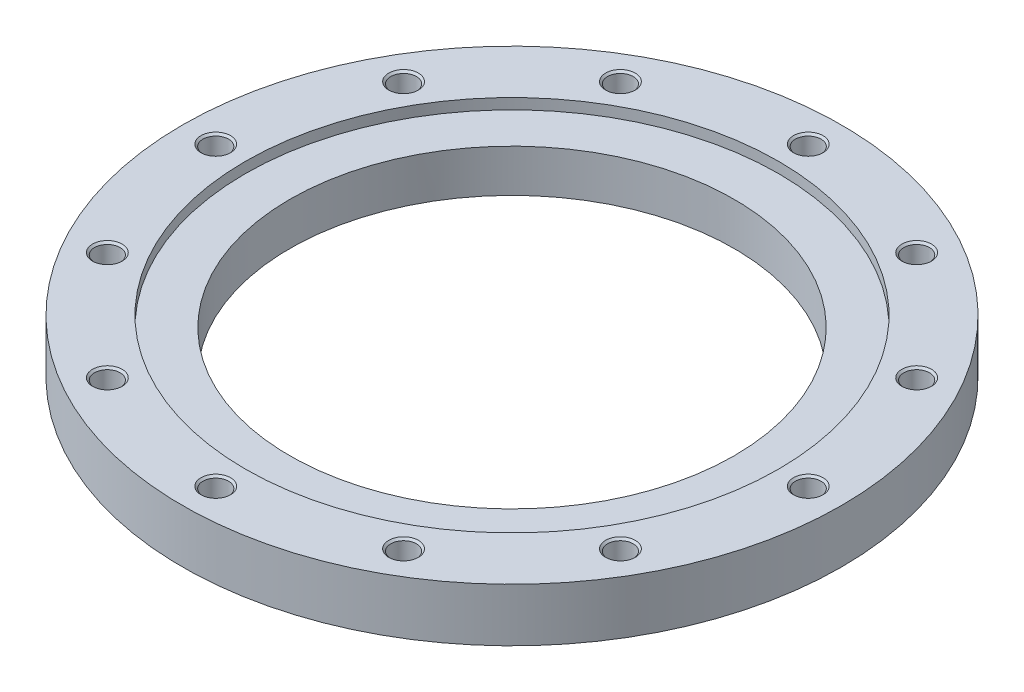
ISO-10303-21;
HEADER;
FILE_DESCRIPTION(('STEP AP214'),'2;1');
FILE_NAME('part.step','',(''),(''),'','','');
FILE_SCHEMA(('AUTOMOTIVE_DESIGN { 1 0 10303 214 1 1 1 1 }'));
ENDSEC;
DATA;
#1=APPLICATION_CONTEXT('core data for automotive mechanical design processes');
#2=APPLICATION_PROTOCOL_DEFINITION('international standard','automotive_design',2000,#1);
#3=PRODUCT_CONTEXT('',#1,'mechanical');
#4=PRODUCT('Part','Part','',(#3));
#5=PRODUCT_RELATED_PRODUCT_CATEGORY('part','',(#4));
#6=PRODUCT_DEFINITION_FORMATION('','',#4);
#7=PRODUCT_DEFINITION_CONTEXT('part definition',#1,'design');
#8=PRODUCT_DEFINITION('design','',#6,#7);
#9=PRODUCT_DEFINITION_SHAPE('','',#8);
#10=(LENGTH_UNIT() NAMED_UNIT(*) SI_UNIT(.MILLI.,.METRE.));
#11=(NAMED_UNIT(*) PLANE_ANGLE_UNIT() SI_UNIT($,.RADIAN.));
#12=(NAMED_UNIT(*) SI_UNIT($,.STERADIAN.) SOLID_ANGLE_UNIT());
#13=UNCERTAINTY_MEASURE_WITH_UNIT(LENGTH_MEASURE(1.E-05),#10,'distance_accuracy_value','');
#14=(GEOMETRIC_REPRESENTATION_CONTEXT(3) GLOBAL_UNCERTAINTY_ASSIGNED_CONTEXT((#13)) GLOBAL_UNIT_ASSIGNED_CONTEXT((#10,
#11,#12)) REPRESENTATION_CONTEXT('',''));
#15=CARTESIAN_POINT('',(0.,0.,0.));
#16=DIRECTION('',(0.,0.,1.));
#17=DIRECTION('',(1.,0.,0.));
#18=AXIS2_PLACEMENT_3D('',#15,#16,#17);
#19=CARTESIAN_POINT('',(0.,18.,0.));
#20=DIRECTION('',(0.,-1.,0.));
#21=DIRECTION('',(1.,0.,0.));
#22=AXIS2_PLACEMENT_3D('',#19,#20,#21);
#23=CYLINDRICAL_SURFACE('',#22,222.5);
#24=CARTESIAN_POINT('',(0.,0.,0.));
#25=DIRECTION('',(0.,1.,0.));
#26=DIRECTION('',(1.,0.,0.));
#27=AXIS2_PLACEMENT_3D('',#24,#25,#26);
#28=CIRCLE('',#27,222.5);
#29=CARTESIAN_POINT('',(222.5,0.,0.));
#30=VERTEX_POINT('',#29);
#31=EDGE_CURVE('E9',#30,#30,#28,.T.);
#32=ORIENTED_EDGE('',*,*,#31,.T.);
#33=EDGE_LOOP('',(#32));
#34=FACE_BOUND('',#33,.T.);
#35=CARTESIAN_POINT('',(0.,36.,0.));
#36=DIRECTION('',(0.,1.,0.));
#37=DIRECTION('',(1.,0.,0.));
#38=AXIS2_PLACEMENT_3D('',#35,#36,#37);
#39=CIRCLE('',#38,222.5);
#40=CARTESIAN_POINT('',(222.5,36.,0.));
#41=VERTEX_POINT('',#40);
#42=EDGE_CURVE('E311',#41,#41,#39,.T.);
#43=ORIENTED_EDGE('',*,*,#42,.F.);
#44=EDGE_LOOP('',(#43));
#45=FACE_BOUND('',#44,.T.);
#46=ADVANCED_FACE('F15',(#34,#45),#23,.T.);
#47=CARTESIAN_POINT('',(186.25,0.,0.));
#48=DIRECTION('',(0.,-1.,0.));
#49=DIRECTION('',(-1.,0.,0.));
#50=AXIS2_PLACEMENT_3D('',#47,#48,#49);
#51=PLANE('',#50);
#52=CARTESIAN_POINT('',(0.,0.,0.));
#53=DIRECTION('',(0.,1.,0.));
#54=DIRECTION('',(1.,0.,0.));
#55=AXIS2_PLACEMENT_3D('',#52,#53,#54);
#56=CIRCLE('',#55,150.);
#57=CARTESIAN_POINT('',(150.,0.,0.));
#58=VERTEX_POINT('',#57);
#59=EDGE_CURVE('E22',#58,#58,#56,.T.);
#60=ORIENTED_EDGE('',*,*,#59,.T.);
#61=EDGE_LOOP('',(#60));
#62=FACE_BOUND('',#61,.T.);
#63=ORIENTED_EDGE('',*,*,#31,.F.);
#64=EDGE_LOOP('',(#63));
#65=FACE_BOUND('',#64,.T.);
#66=ADVANCED_FACE('F470',(#62,#65),#51,.T.);
#67=CARTESIAN_POINT('',(0.,18.,0.));
#68=DIRECTION('',(0.,-1.,0.));
#69=DIRECTION('',(1.,0.,0.));
#70=AXIS2_PLACEMENT_3D('',#67,#68,#69);
#71=CYLINDRICAL_SURFACE('',#70,150.);
#72=ORIENTED_EDGE('',*,*,#59,.F.);
#73=EDGE_LOOP('',(#72));
#74=FACE_BOUND('',#73,.T.);
#75=CARTESIAN_POINT('',(0.,28.8,0.));
#76=DIRECTION('',(0.,1.,0.));
#77=DIRECTION('',(1.,0.,0.));
#78=AXIS2_PLACEMENT_3D('',#75,#76,#77);
#79=CIRCLE('',#78,150.);
#80=CARTESIAN_POINT('',(-150.,28.8,0.));
#81=VERTEX_POINT('',#80);
#82=EDGE_CURVE('E310',#81,#81,#79,.T.);
#83=ORIENTED_EDGE('',*,*,#82,.T.);
#84=EDGE_LOOP('',(#83));
#85=FACE_BOUND('',#84,.T.);
#86=ADVANCED_FACE('F474',(#74,#85),#71,.F.);
#87=CARTESIAN_POINT('',(186.25,36.,0.));
#88=DIRECTION('',(0.,1.,0.));
#89=DIRECTION('',(1.,0.,0.));
#90=AXIS2_PLACEMENT_3D('',#87,#88,#89);
#91=PLANE('',#90);
#92=ORIENTED_EDGE('',*,*,#42,.T.);
#93=EDGE_LOOP('',(#92));
#94=FACE_BOUND('',#93,.T.);
#95=CARTESIAN_POINT('',(0.,36.,0.));
#96=DIRECTION('',(0.,-1.,0.));
#97=DIRECTION('',(1.,0.,0.));
#98=AXIS2_PLACEMENT_3D('',#95,#96,#97);
#99=CIRCLE('',#98,180.);
#100=CARTESIAN_POINT('',(-180.,36.,0.));
#101=VERTEX_POINT('',#100);
#102=EDGE_CURVE('E301',#101,#101,#99,.T.);
#103=ORIENTED_EDGE('',*,*,#102,.T.);
#104=EDGE_LOOP('',(#103));
#105=FACE_BOUND('',#104,.T.);
#106=CARTESIAN_POINT('',(200.,36.,0.));
#107=DIRECTION('',(0.,-1.,0.));
#108=DIRECTION('',(1.,0.,0.));
#109=AXIS2_PLACEMENT_3D('',#106,#107,#108);
#110=CIRCLE('',#109,10.);
#111=CARTESIAN_POINT('',(210.,36.,0.));
#112=VERTEX_POINT('',#111);
#113=EDGE_CURVE('E331',#112,#112,#110,.T.);
#114=ORIENTED_EDGE('',*,*,#113,.T.);
#115=EDGE_LOOP('',(#114));
#116=FACE_BOUND('',#115,.T.);
#117=CARTESIAN_POINT('',(173.205080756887,36.,-100.));
#118=DIRECTION('',(0.,-1.,0.));
#119=DIRECTION('',(0.866025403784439,0.,-0.5));
#120=AXIS2_PLACEMENT_3D('',#117,#118,#119);
#121=CIRCLE('',#120,10.);
#122=CARTESIAN_POINT('',(181.865334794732,36.,-105.));
#123=VERTEX_POINT('',#122);
#124=EDGE_CURVE('E326',#123,#123,#121,.T.);
#125=ORIENTED_EDGE('',*,*,#124,.T.);
#126=EDGE_LOOP('',(#125));
#127=FACE_BOUND('',#126,.T.);
#128=CARTESIAN_POINT('',(100.,36.,-173.205080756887));
#129=DIRECTION('',(0.,-1.,0.));
#130=DIRECTION('',(0.5,0.,-0.866025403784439));
#131=AXIS2_PLACEMENT_3D('',#128,#129,#130);
#132=CIRCLE('',#131,10.);
#133=CARTESIAN_POINT('',(105.,36.,-181.865334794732));
#134=VERTEX_POINT('',#133);
#135=EDGE_CURVE('E346',#134,#134,#132,.T.);
#136=ORIENTED_EDGE('',*,*,#135,.T.);
#137=EDGE_LOOP('',(#136));
#138=FACE_BOUND('',#137,.T.);
#139=CARTESIAN_POINT('',(0.,36.,-200.));
#140=DIRECTION('',(0.,-1.,0.));
#141=DIRECTION('',(0.,0.,-1.));
#142=AXIS2_PLACEMENT_3D('',#139,#140,#141);
#143=CIRCLE('',#142,10.);
#144=CARTESIAN_POINT('',(0.,36.,-210.));
#145=VERTEX_POINT('',#144);
#146=EDGE_CURVE('E355',#145,#145,#143,.T.);
#147=ORIENTED_EDGE('',*,*,#146,.T.);
#148=EDGE_LOOP('',(#147));
#149=FACE_BOUND('',#148,.T.);
#150=CARTESIAN_POINT('',(-100.,36.,-173.205080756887));
#151=DIRECTION('',(0.,-1.,0.));
#152=DIRECTION('',(-0.5,0.,-0.866025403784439));
#153=AXIS2_PLACEMENT_3D('',#150,#151,#152);
#154=CIRCLE('',#153,10.);
#155=CARTESIAN_POINT('',(-105.,36.,-181.865334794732));
#156=VERTEX_POINT('',#155);
#157=EDGE_CURVE('E368',#156,#156,#154,.T.);
#158=ORIENTED_EDGE('',*,*,#157,.T.);
#159=EDGE_LOOP('',(#158));
#160=FACE_BOUND('',#159,.T.);
#161=CARTESIAN_POINT('',(-173.205080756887,36.,-100.));
#162=DIRECTION('',(0.,-1.,0.));
#163=DIRECTION('',(-0.866025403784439,0.,-0.5));
#164=AXIS2_PLACEMENT_3D('',#161,#162,#163);
#165=CIRCLE('',#164,10.);
#166=CARTESIAN_POINT('',(-181.865334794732,36.,-105.));
#167=VERTEX_POINT('',#166);
#168=EDGE_CURVE('E352',#167,#167,#165,.T.);
#169=ORIENTED_EDGE('',*,*,#168,.T.);
#170=EDGE_LOOP('',(#169));
#171=FACE_BOUND('',#170,.T.);
#172=CARTESIAN_POINT('',(-200.,36.,0.));
#173=DIRECTION('',(0.,-1.,0.));
#174=DIRECTION('',(-1.,0.,0.));
#175=AXIS2_PLACEMENT_3D('',#172,#173,#174);
#176=CIRCLE('',#175,10.);
#177=CARTESIAN_POINT('',(-210.,36.,0.));
#178=VERTEX_POINT('',#177);
#179=EDGE_CURVE('E422',#178,#178,#176,.T.);
#180=ORIENTED_EDGE('',*,*,#179,.T.);
#181=EDGE_LOOP('',(#180));
#182=FACE_BOUND('',#181,.T.);
#183=CARTESIAN_POINT('',(-173.205080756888,36.,100.));
#184=DIRECTION('',(0.,-1.,0.));
#185=DIRECTION('',(-0.866025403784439,0.,0.5));
#186=AXIS2_PLACEMENT_3D('',#183,#184,#185);
#187=CIRCLE('',#186,10.);
#188=CARTESIAN_POINT('',(-181.865334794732,36.,105.));
#189=VERTEX_POINT('',#188);
#190=EDGE_CURVE('E410',#189,#189,#187,.T.);
#191=ORIENTED_EDGE('',*,*,#190,.T.);
#192=EDGE_LOOP('',(#191));
#193=FACE_BOUND('',#192,.T.);
#194=CARTESIAN_POINT('',(-100.,36.,173.205080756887));
#195=DIRECTION('',(0.,-1.,0.));
#196=DIRECTION('',(-0.5,0.,0.866025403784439));
#197=AXIS2_PLACEMENT_3D('',#194,#195,#196);
#198=CIRCLE('',#197,10.);
#199=CARTESIAN_POINT('',(-105.,36.,181.865334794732));
#200=VERTEX_POINT('',#199);
#201=EDGE_CURVE('E1126',#200,#200,#198,.T.);
#202=ORIENTED_EDGE('',*,*,#201,.T.);
#203=EDGE_LOOP('',(#202));
#204=FACE_BOUND('',#203,.T.);
#205=CARTESIAN_POINT('',(0.,36.,200.));
#206=DIRECTION('',(0.,-1.,0.));
#207=DIRECTION('',(0.,0.,1.));
#208=AXIS2_PLACEMENT_3D('',#205,#206,#207);
#209=CIRCLE('',#208,10.);
#210=CARTESIAN_POINT('',(0.,36.,210.));
#211=VERTEX_POINT('',#210);
#212=EDGE_CURVE('E1112',#211,#211,#209,.T.);
#213=ORIENTED_EDGE('',*,*,#212,.T.);
#214=EDGE_LOOP('',(#213));
#215=FACE_BOUND('',#214,.T.);
#216=CARTESIAN_POINT('',(100.,36.,173.205080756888));
#217=DIRECTION('',(0.,-1.,0.));
#218=DIRECTION('',(0.5,0.,0.866025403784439));
#219=AXIS2_PLACEMENT_3D('',#216,#217,#218);
#220=CIRCLE('',#219,10.);
#221=CARTESIAN_POINT('',(105.,36.,181.865334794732));
#222=VERTEX_POINT('',#221);
#223=EDGE_CURVE('E1141',#222,#222,#220,.T.);
#224=ORIENTED_EDGE('',*,*,#223,.T.);
#225=EDGE_LOOP('',(#224));
#226=FACE_BOUND('',#225,.T.);
#227=CARTESIAN_POINT('',(173.205080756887,36.,100.));
#228=DIRECTION('',(0.,-1.,0.));
#229=DIRECTION('',(0.866025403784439,0.,0.5));
#230=AXIS2_PLACEMENT_3D('',#227,#228,#229);
#231=CIRCLE('',#230,10.);
#232=CARTESIAN_POINT('',(181.865334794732,36.,105.));
#233=VERTEX_POINT('',#232);
#234=EDGE_CURVE('E1136',#233,#233,#231,.T.);
#235=ORIENTED_EDGE('',*,*,#234,.T.);
#236=EDGE_LOOP('',(#235));
#237=FACE_BOUND('',#236,.T.);
#238=ADVANCED_FACE('F425',(#94,#105,#116,#127,#138,#149,#160,#171,#182,#193,#204,#215,#226,
#237),#91,.T.);
#239=CARTESIAN_POINT('',(0.,28.8,0.));
#240=DIRECTION('',(0.,-1.,0.));
#241=DIRECTION('',(-1.,0.,0.));
#242=AXIS2_PLACEMENT_3D('',#239,#240,#241);
#243=PLANE('',#242);
#244=CARTESIAN_POINT('',(0.,28.8,0.));
#245=DIRECTION('',(0.,-1.,0.));
#246=DIRECTION('',(1.,0.,0.));
#247=AXIS2_PLACEMENT_3D('',#244,#245,#246);
#248=CIRCLE('',#247,180.);
#249=CARTESIAN_POINT('',(180.,28.8,0.));
#250=VERTEX_POINT('',#249);
#251=EDGE_CURVE('E308',#250,#250,#248,.T.);
#252=ORIENTED_EDGE('',*,*,#251,.F.);
#253=EDGE_LOOP('',(#252));
#254=FACE_BOUND('',#253,.T.);
#255=ORIENTED_EDGE('',*,*,#82,.F.);
#256=EDGE_LOOP('',(#255));
#257=FACE_BOUND('',#256,.T.);
#258=ADVANCED_FACE('F487',(#254,#257),#243,.F.);
#259=CARTESIAN_POINT('',(0.,34.2,0.));
#260=DIRECTION('',(0.,-1.,0.));
#261=DIRECTION('',(1.,0.,0.));
#262=AXIS2_PLACEMENT_3D('',#259,#260,#261);
#263=CYLINDRICAL_SURFACE('',#262,180.);
#264=ORIENTED_EDGE('',*,*,#251,.T.);
#265=EDGE_LOOP('',(#264));
#266=FACE_BOUND('',#265,.T.);
#267=ORIENTED_EDGE('',*,*,#102,.F.);
#268=EDGE_LOOP('',(#267));
#269=FACE_BOUND('',#268,.T.);
#270=ADVANCED_FACE('F483',(#266,#269),#263,.F.);
#271=CARTESIAN_POINT('',(200.,5.50386219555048,0.));
#272=DIRECTION('',(0.,1.,0.));
#273=DIRECTION('',(1.,0.,0.));
#274=AXIS2_PLACEMENT_3D('',#271,#272,#273);
#275=CONICAL_SURFACE('',#274,4.3234375,1.0471975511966);
#276=CARTESIAN_POINT('',(200.,8.,0.));
#277=DIRECTION('',(0.,-1.,0.));
#278=DIRECTION('',(1.,0.,0.));
#279=AXIS2_PLACEMENT_3D('',#276,#277,#278);
#280=CIRCLE('',#279,8.646875);
#281=CARTESIAN_POINT('',(208.646875,8.,0.));
#282=VERTEX_POINT('',#281);
#283=EDGE_CURVE('E298',#282,#282,#280,.T.);
#284=ORIENTED_EDGE('',*,*,#283,.F.);
#285=EDGE_LOOP('',(#284));
#286=FACE_BOUND('',#285,.T.);
#287=CARTESIAN_POINT('',(200.,3.00772439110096,0.));
#288=VERTEX_POINT('',#287);
#289=VERTEX_LOOP('',#288);
#290=FACE_BOUND('',#289,.T.);
#291=ADVANCED_FACE('F486',(#286,#290),#275,.F.);
#292=CARTESIAN_POINT('',(200.,11.3234375,0.));
#293=DIRECTION('',(0.,1.,0.));
#294=DIRECTION('',(1.,0.,0.));
#295=AXIS2_PLACEMENT_3D('',#292,#293,#294);
#296=CYLINDRICAL_SURFACE('',#295,8.646875);
#297=CARTESIAN_POINT('',(200.,14.646875,0.));
#298=DIRECTION('',(0.,-1.,0.));
#299=DIRECTION('',(1.,0.,0.));
#300=AXIS2_PLACEMENT_3D('',#297,#298,#299);
#301=CIRCLE('',#300,8.646875);
#302=CARTESIAN_POINT('',(208.646875,14.646875,0.));
#303=VERTEX_POINT('',#302);
#304=EDGE_CURVE('E295',#303,#303,#301,.T.);
#305=ORIENTED_EDGE('',*,*,#304,.F.);
#306=EDGE_LOOP('',(#305));
#307=FACE_BOUND('',#306,.T.);
#308=ORIENTED_EDGE('',*,*,#283,.T.);
#309=EDGE_LOOP('',(#308));
#310=FACE_BOUND('',#309,.T.);
#311=ADVANCED_FACE('F491',(#307,#310),#296,.F.);
#312=CARTESIAN_POINT('',(200.,15.3234375,0.));
#313=DIRECTION('',(0.,1.,0.));
#314=DIRECTION('',(1.,0.,0.));
#315=AXIS2_PLACEMENT_3D('',#312,#313,#314);
#316=CONICAL_SURFACE('',#315,9.3234375,0.785398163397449);
#317=CARTESIAN_POINT('',(200.,16.,0.));
#318=DIRECTION('',(0.,-1.,0.));
#319=DIRECTION('',(1.,0.,0.));
#320=AXIS2_PLACEMENT_3D('',#317,#318,#319);
#321=CIRCLE('',#320,10.);
#322=CARTESIAN_POINT('',(210.,16.,0.));
#323=VERTEX_POINT('',#322);
#324=EDGE_CURVE('E299',#323,#323,#321,.T.);
#325=ORIENTED_EDGE('',*,*,#324,.F.);
#326=EDGE_LOOP('',(#325));
#327=FACE_BOUND('',#326,.T.);
#328=ORIENTED_EDGE('',*,*,#304,.T.);
#329=EDGE_LOOP('',(#328));
#330=FACE_BOUND('',#329,.T.);
#331=ADVANCED_FACE('F296',(#327,#330),#316,.F.);
#332=CARTESIAN_POINT('',(209.3234375,16.,0.));
#333=DIRECTION('',(0.,1.,0.));
#334=DIRECTION('',(-1.,0.,0.));
#335=AXIS2_PLACEMENT_3D('',#332,#333,#334);
#336=PLANE('',#335);
#337=CARTESIAN_POINT('',(200.,16.,0.));
#338=DIRECTION('',(0.,-1.,0.));
#339=DIRECTION('',(1.,0.,0.));
#340=AXIS2_PLACEMENT_3D('',#337,#338,#339);
#341=CIRCLE('',#340,8.646875);
#342=CARTESIAN_POINT('',(208.646875,16.,0.));
#343=VERTEX_POINT('',#342);
#344=EDGE_CURVE('E303',#343,#343,#341,.T.);
#345=ORIENTED_EDGE('',*,*,#344,.F.);
#346=EDGE_LOOP('',(#345));
#347=FACE_BOUND('',#346,.T.);
#348=ORIENTED_EDGE('',*,*,#324,.T.);
#349=EDGE_LOOP('',(#348));
#350=FACE_BOUND('',#349,.T.);
#351=ADVANCED_FACE('F495',(#347,#350),#336,.F.);
#352=CARTESIAN_POINT('',(200.,25.3234375,0.));
#353=DIRECTION('',(0.,1.,0.));
#354=DIRECTION('',(1.,0.,0.));
#355=AXIS2_PLACEMENT_3D('',#352,#353,#354);
#356=CYLINDRICAL_SURFACE('',#355,8.646875);
#357=CARTESIAN_POINT('',(200.,34.646875,0.));
#358=DIRECTION('',(0.,-1.,0.));
#359=DIRECTION('',(1.,0.,0.));
#360=AXIS2_PLACEMENT_3D('',#357,#358,#359);
#361=CIRCLE('',#360,8.646875);
#362=CARTESIAN_POINT('',(208.646875,34.646875,0.));
#363=VERTEX_POINT('',#362);
#364=EDGE_CURVE('E330',#363,#363,#361,.T.);
#365=ORIENTED_EDGE('',*,*,#364,.F.);
#366=EDGE_LOOP('',(#365));
#367=FACE_BOUND('',#366,.T.);
#368=ORIENTED_EDGE('',*,*,#344,.T.);
#369=EDGE_LOOP('',(#368));
#370=FACE_BOUND('',#369,.T.);
#371=ADVANCED_FACE('F499',(#367,#370),#356,.F.);
#372=CARTESIAN_POINT('',(200.,35.3234375,0.));
#373=DIRECTION('',(0.,1.,0.));
#374=DIRECTION('',(1.,0.,0.));
#375=AXIS2_PLACEMENT_3D('',#372,#373,#374);
#376=CONICAL_SURFACE('',#375,9.3234375,0.785398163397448);
#377=ORIENTED_EDGE('',*,*,#113,.F.);
#378=EDGE_LOOP('',(#377));
#379=FACE_BOUND('',#378,.T.);
#380=ORIENTED_EDGE('',*,*,#364,.T.);
#381=EDGE_LOOP('',(#380));
#382=FACE_BOUND('',#381,.T.);
#383=ADVANCED_FACE('F503',(#379,#382),#376,.F.);
#384=CARTESIAN_POINT('',(173.205080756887,5.50386219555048,-100.));
#385=DIRECTION('',(0.,1.,0.));
#386=DIRECTION('',(0.866025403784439,0.,-0.5));
#387=AXIS2_PLACEMENT_3D('',#384,#385,#386);
#388=CONICAL_SURFACE('',#387,4.3234375,1.0471975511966);
#389=CARTESIAN_POINT('',(173.205080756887,8.,-100.));
#390=DIRECTION('',(0.,-1.,0.));
#391=DIRECTION('',(0.866025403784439,0.,-0.5));
#392=AXIS2_PLACEMENT_3D('',#389,#390,#391);
#393=CIRCLE('',#392,8.646875);
#394=CARTESIAN_POINT('',(180.693494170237,8.,-104.3234375));
#395=VERTEX_POINT('',#394);
#396=EDGE_CURVE('E329',#395,#395,#393,.T.);
#397=ORIENTED_EDGE('',*,*,#396,.F.);
#398=EDGE_LOOP('',(#397));
#399=FACE_BOUND('',#398,.T.);
#400=CARTESIAN_POINT('',(173.205080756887,3.00772439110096,-100.));
#401=VERTEX_POINT('',#400);
#402=VERTEX_LOOP('',#401);
#403=FACE_BOUND('',#402,.T.);
#404=ADVANCED_FACE('F507',(#399,#403),#388,.F.);
#405=CARTESIAN_POINT('',(173.205080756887,11.3234375,-100.));
#406=DIRECTION('',(0.,1.,0.));
#407=DIRECTION('',(0.866025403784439,0.,-0.5));
#408=AXIS2_PLACEMENT_3D('',#405,#406,#407);
#409=CYLINDRICAL_SURFACE('',#408,8.646875);
#410=CARTESIAN_POINT('',(173.205080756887,14.646875,-100.));
#411=DIRECTION('',(0.,-1.,0.));
#412=DIRECTION('',(0.866025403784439,0.,-0.5));
#413=AXIS2_PLACEMENT_3D('',#410,#411,#412);
#414=CIRCLE('',#413,8.646875);
#415=CARTESIAN_POINT('',(180.693494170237,14.646875,-104.3234375));
#416=VERTEX_POINT('',#415);
#417=EDGE_CURVE('E327',#416,#416,#414,.T.);
#418=ORIENTED_EDGE('',*,*,#417,.F.);
#419=EDGE_LOOP('',(#418));
#420=FACE_BOUND('',#419,.T.);
#421=ORIENTED_EDGE('',*,*,#396,.T.);
#422=EDGE_LOOP('',(#421));
#423=FACE_BOUND('',#422,.T.);
#424=ADVANCED_FACE('F511',(#420,#423),#409,.F.);
#425=CARTESIAN_POINT('',(173.205080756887,15.3234375,-100.));
#426=DIRECTION('',(0.,1.,0.));
#427=DIRECTION('',(0.866025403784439,0.,-0.5));
#428=AXIS2_PLACEMENT_3D('',#425,#426,#427);
#429=CONICAL_SURFACE('',#428,9.3234375,0.785398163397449);
#430=CARTESIAN_POINT('',(173.205080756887,16.,-100.));
#431=DIRECTION('',(0.,-1.,0.));
#432=DIRECTION('',(0.866025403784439,0.,-0.5));
#433=AXIS2_PLACEMENT_3D('',#430,#431,#432);
#434=CIRCLE('',#433,10.);
#435=CARTESIAN_POINT('',(181.865334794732,16.,-105.));
#436=VERTEX_POINT('',#435);
#437=EDGE_CURVE('E325',#436,#436,#434,.T.);
#438=ORIENTED_EDGE('',*,*,#437,.F.);
#439=EDGE_LOOP('',(#438));
#440=FACE_BOUND('',#439,.T.);
#441=ORIENTED_EDGE('',*,*,#417,.T.);
#442=EDGE_LOOP('',(#441));
#443=FACE_BOUND('',#442,.T.);
#444=ADVANCED_FACE('F515',(#440,#443),#429,.F.);
#445=CARTESIAN_POINT('',(181.279414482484,16.,-104.66171875));
#446=DIRECTION('',(0.,1.,0.));
#447=DIRECTION('',(-0.866025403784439,0.,0.5));
#448=AXIS2_PLACEMENT_3D('',#445,#446,#447);
#449=PLANE('',#448);
#450=CARTESIAN_POINT('',(173.205080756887,16.,-100.));
#451=DIRECTION('',(0.,-1.,0.));
#452=DIRECTION('',(0.866025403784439,0.,-0.5));
#453=AXIS2_PLACEMENT_3D('',#450,#451,#452);
#454=CIRCLE('',#453,8.646875);
#455=CARTESIAN_POINT('',(180.693494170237,16.,-104.3234375));
#456=VERTEX_POINT('',#455);
#457=EDGE_CURVE('E323',#456,#456,#454,.T.);
#458=ORIENTED_EDGE('',*,*,#457,.F.);
#459=EDGE_LOOP('',(#458));
#460=FACE_BOUND('',#459,.T.);
#461=ORIENTED_EDGE('',*,*,#437,.T.);
#462=EDGE_LOOP('',(#461));
#463=FACE_BOUND('',#462,.T.);
#464=ADVANCED_FACE('F1074',(#460,#463),#449,.F.);
#465=CARTESIAN_POINT('',(173.205080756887,25.3234375,-100.));
#466=DIRECTION('',(0.,1.,0.));
#467=DIRECTION('',(0.866025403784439,0.,-0.5));
#468=AXIS2_PLACEMENT_3D('',#465,#466,#467);
#469=CYLINDRICAL_SURFACE('',#468,8.646875);
#470=CARTESIAN_POINT('',(173.205080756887,34.646875,-100.));
#471=DIRECTION('',(0.,-1.,0.));
#472=DIRECTION('',(0.866025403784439,0.,-0.5));
#473=AXIS2_PLACEMENT_3D('',#470,#471,#472);
#474=CIRCLE('',#473,8.646875);
#475=CARTESIAN_POINT('',(180.693494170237,34.646875,-104.3234375));
#476=VERTEX_POINT('',#475);
#477=EDGE_CURVE('E321',#476,#476,#474,.T.);
#478=ORIENTED_EDGE('',*,*,#477,.F.);
#479=EDGE_LOOP('',(#478));
#480=FACE_BOUND('',#479,.T.);
#481=ORIENTED_EDGE('',*,*,#457,.T.);
#482=EDGE_LOOP('',(#481));
#483=FACE_BOUND('',#482,.T.);
#484=ADVANCED_FACE('F521',(#480,#483),#469,.F.);
#485=CARTESIAN_POINT('',(173.205080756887,35.3234375,-100.));
#486=DIRECTION('',(0.,1.,0.));
#487=DIRECTION('',(0.866025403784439,0.,-0.5));
#488=AXIS2_PLACEMENT_3D('',#485,#486,#487);
#489=CONICAL_SURFACE('',#488,9.3234375,0.785398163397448);
#490=ORIENTED_EDGE('',*,*,#124,.F.);
#491=EDGE_LOOP('',(#490));
#492=FACE_BOUND('',#491,.T.);
#493=ORIENTED_EDGE('',*,*,#477,.T.);
#494=EDGE_LOOP('',(#493));
#495=FACE_BOUND('',#494,.T.);
#496=ADVANCED_FACE('F517',(#492,#495),#489,.F.);
#497=CARTESIAN_POINT('',(100.,5.50386219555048,-173.205080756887));
#498=DIRECTION('',(0.,1.,0.));
#499=DIRECTION('',(0.5,0.,-0.866025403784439));
#500=AXIS2_PLACEMENT_3D('',#497,#498,#499);
#501=CONICAL_SURFACE('',#500,4.3234375,1.0471975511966);
#502=CARTESIAN_POINT('',(100.,8.,-173.205080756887));
#503=DIRECTION('',(0.,-1.,0.));
#504=DIRECTION('',(0.5,0.,-0.866025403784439));
#505=AXIS2_PLACEMENT_3D('',#502,#503,#504);
#506=CIRCLE('',#505,8.646875);
#507=CARTESIAN_POINT('',(104.3234375,8.,-180.693494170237));
#508=VERTEX_POINT('',#507);
#509=EDGE_CURVE('E319',#508,#508,#506,.T.);
#510=ORIENTED_EDGE('',*,*,#509,.F.);
#511=EDGE_LOOP('',(#510));
#512=FACE_BOUND('',#511,.T.);
#513=CARTESIAN_POINT('',(100.,3.00772439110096,-173.205080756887));
#514=VERTEX_POINT('',#513);
#515=VERTEX_LOOP('',#514);
#516=FACE_BOUND('',#515,.T.);
#517=ADVANCED_FACE('F520',(#512,#516),#501,.F.);
#518=CARTESIAN_POINT('',(100.,11.3234375,-173.205080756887));
#519=DIRECTION('',(0.,1.,0.));
#520=DIRECTION('',(0.5,0.,-0.866025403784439));
#521=AXIS2_PLACEMENT_3D('',#518,#519,#520);
#522=CYLINDRICAL_SURFACE('',#521,8.646875);
#523=CARTESIAN_POINT('',(100.,14.646875,-173.205080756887));
#524=DIRECTION('',(0.,-1.,0.));
#525=DIRECTION('',(0.5,0.,-0.866025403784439));
#526=AXIS2_PLACEMENT_3D('',#523,#524,#525);
#527=CIRCLE('',#526,8.646875);
#528=CARTESIAN_POINT('',(104.3234375,14.646875,-180.693494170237));
#529=VERTEX_POINT('',#528);
#530=EDGE_CURVE('E322',#529,#529,#527,.T.);
#531=ORIENTED_EDGE('',*,*,#530,.F.);
#532=EDGE_LOOP('',(#531));
#533=FACE_BOUND('',#532,.T.);
#534=ORIENTED_EDGE('',*,*,#509,.T.);
#535=EDGE_LOOP('',(#534));
#536=FACE_BOUND('',#535,.T.);
#537=ADVANCED_FACE('F525',(#533,#536),#522,.F.);
#538=CARTESIAN_POINT('',(100.,15.3234375,-173.205080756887));
#539=DIRECTION('',(0.,1.,0.));
#540=DIRECTION('',(0.5,0.,-0.866025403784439));
#541=AXIS2_PLACEMENT_3D('',#538,#539,#540);
#542=CONICAL_SURFACE('',#541,9.3234375,0.785398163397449);
#543=CARTESIAN_POINT('',(100.,16.,-173.205080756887));
#544=DIRECTION('',(0.,-1.,0.));
#545=DIRECTION('',(0.5,0.,-0.866025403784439));
#546=AXIS2_PLACEMENT_3D('',#543,#544,#545);
#547=CIRCLE('',#546,10.);
#548=CARTESIAN_POINT('',(105.,16.,-181.865334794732));
#549=VERTEX_POINT('',#548);
#550=EDGE_CURVE('E395',#549,#549,#547,.T.);
#551=ORIENTED_EDGE('',*,*,#550,.F.);
#552=EDGE_LOOP('',(#551));
#553=FACE_BOUND('',#552,.T.);
#554=ORIENTED_EDGE('',*,*,#530,.T.);
#555=EDGE_LOOP('',(#554));
#556=FACE_BOUND('',#555,.T.);
#557=ADVANCED_FACE('F527',(#553,#556),#542,.F.);
#558=CARTESIAN_POINT('',(104.66171875,16.,-181.279414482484));
#559=DIRECTION('',(0.,1.,0.));
#560=DIRECTION('',(-0.5,0.,0.866025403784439));
#561=AXIS2_PLACEMENT_3D('',#558,#559,#560);
#562=PLANE('',#561);
#563=CARTESIAN_POINT('',(100.,16.,-173.205080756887));
#564=DIRECTION('',(0.,-1.,0.));
#565=DIRECTION('',(0.5,0.,-0.866025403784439));
#566=AXIS2_PLACEMENT_3D('',#563,#564,#565);
#567=CIRCLE('',#566,8.646875);
#568=CARTESIAN_POINT('',(104.3234375,16.,-180.693494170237));
#569=VERTEX_POINT('',#568);
#570=EDGE_CURVE('E317',#569,#569,#567,.T.);
#571=ORIENTED_EDGE('',*,*,#570,.F.);
#572=EDGE_LOOP('',(#571));
#573=FACE_BOUND('',#572,.T.);
#574=ORIENTED_EDGE('',*,*,#550,.T.);
#575=EDGE_LOOP('',(#574));
#576=FACE_BOUND('',#575,.T.);
#577=ADVANCED_FACE('F391',(#573,#576),#562,.F.);
#578=CARTESIAN_POINT('',(100.,25.3234375,-173.205080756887));
#579=DIRECTION('',(0.,1.,0.));
#580=DIRECTION('',(0.5,0.,-0.866025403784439));
#581=AXIS2_PLACEMENT_3D('',#578,#579,#580);
#582=CYLINDRICAL_SURFACE('',#581,8.646875);
#583=CARTESIAN_POINT('',(100.,34.646875,-173.205080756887));
#584=DIRECTION('',(0.,-1.,0.));
#585=DIRECTION('',(0.5,0.,-0.866025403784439));
#586=AXIS2_PLACEMENT_3D('',#583,#584,#585);
#587=CIRCLE('',#586,8.646875);
#588=CARTESIAN_POINT('',(104.3234375,34.646875,-180.693494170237));
#589=VERTEX_POINT('',#588);
#590=EDGE_CURVE('E348',#589,#589,#587,.T.);
#591=ORIENTED_EDGE('',*,*,#590,.F.);
#592=EDGE_LOOP('',(#591));
#593=FACE_BOUND('',#592,.T.);
#594=ORIENTED_EDGE('',*,*,#570,.T.);
#595=EDGE_LOOP('',(#594));
#596=FACE_BOUND('',#595,.T.);
#597=ADVANCED_FACE('F388',(#593,#596),#582,.F.);
#598=CARTESIAN_POINT('',(100.,35.3234375,-173.205080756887));
#599=DIRECTION('',(0.,1.,0.));
#600=DIRECTION('',(0.5,0.,-0.866025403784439));
#601=AXIS2_PLACEMENT_3D('',#598,#599,#600);
#602=CONICAL_SURFACE('',#601,9.3234375,0.785398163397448);
#603=ORIENTED_EDGE('',*,*,#135,.F.);
#604=EDGE_LOOP('',(#603));
#605=FACE_BOUND('',#604,.T.);
#606=ORIENTED_EDGE('',*,*,#590,.T.);
#607=EDGE_LOOP('',(#606));
#608=FACE_BOUND('',#607,.T.);
#609=ADVANCED_FACE('F386',(#605,#608),#602,.F.);
#610=CARTESIAN_POINT('',(0.,5.50386219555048,-200.));
#611=DIRECTION('',(0.,1.,0.));
#612=DIRECTION('',(0.,0.,-1.));
#613=AXIS2_PLACEMENT_3D('',#610,#611,#612);
#614=CONICAL_SURFACE('',#613,4.3234375,1.0471975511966);
#615=CARTESIAN_POINT('',(0.,8.,-200.));
#616=DIRECTION('',(0.,-1.,0.));
#617=DIRECTION('',(0.,0.,-1.));
#618=AXIS2_PLACEMENT_3D('',#615,#616,#617);
#619=CIRCLE('',#618,8.646875);
#620=CARTESIAN_POINT('',(0.,8.,-208.646875));
#621=VERTEX_POINT('',#620);
#622=EDGE_CURVE('E383',#621,#621,#619,.T.);
#623=ORIENTED_EDGE('',*,*,#622,.F.);
#624=EDGE_LOOP('',(#623));
#625=FACE_BOUND('',#624,.T.);
#626=CARTESIAN_POINT('',(0.,3.00772439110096,-200.));
#627=VERTEX_POINT('',#626);
#628=VERTEX_LOOP('',#627);
#629=FACE_BOUND('',#628,.T.);
#630=ADVANCED_FACE('F456',(#625,#629),#614,.F.);
#631=CARTESIAN_POINT('',(0.,11.3234375,-200.));
#632=DIRECTION('',(0.,1.,0.));
#633=DIRECTION('',(0.,0.,-1.));
#634=AXIS2_PLACEMENT_3D('',#631,#632,#633);
#635=CYLINDRICAL_SURFACE('',#634,8.646875);
#636=CARTESIAN_POINT('',(0.,14.646875,-200.));
#637=DIRECTION('',(0.,-1.,0.));
#638=DIRECTION('',(0.,0.,-1.));
#639=AXIS2_PLACEMENT_3D('',#636,#637,#638);
#640=CIRCLE('',#639,8.646875);
#641=CARTESIAN_POINT('',(0.,14.646875,-208.646875));
#642=VERTEX_POINT('',#641);
#643=EDGE_CURVE('E381',#642,#642,#640,.T.);
#644=ORIENTED_EDGE('',*,*,#643,.F.);
#645=EDGE_LOOP('',(#644));
#646=FACE_BOUND('',#645,.T.);
#647=ORIENTED_EDGE('',*,*,#622,.T.);
#648=EDGE_LOOP('',(#647));
#649=FACE_BOUND('',#648,.T.);
#650=ADVANCED_FACE('F450',(#646,#649),#635,.F.);
#651=CARTESIAN_POINT('',(0.,15.3234375,-200.));
#652=DIRECTION('',(0.,1.,0.));
#653=DIRECTION('',(0.,0.,-1.));
#654=AXIS2_PLACEMENT_3D('',#651,#652,#653);
#655=CONICAL_SURFACE('',#654,9.3234375,0.785398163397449);
#656=CARTESIAN_POINT('',(0.,16.,-200.));
#657=DIRECTION('',(0.,-1.,0.));
#658=DIRECTION('',(0.,0.,-1.));
#659=AXIS2_PLACEMENT_3D('',#656,#657,#658);
#660=CIRCLE('',#659,10.);
#661=CARTESIAN_POINT('',(0.,16.,-210.));
#662=VERTEX_POINT('',#661);
#663=EDGE_CURVE('E379',#662,#662,#660,.T.);
#664=ORIENTED_EDGE('',*,*,#663,.F.);
#665=EDGE_LOOP('',(#664));
#666=FACE_BOUND('',#665,.T.);
#667=ORIENTED_EDGE('',*,*,#643,.T.);
#668=EDGE_LOOP('',(#667));
#669=FACE_BOUND('',#668,.T.);
#670=ADVANCED_FACE('F444',(#666,#669),#655,.F.);
#671=CARTESIAN_POINT('',(0.,16.,-209.3234375));
#672=DIRECTION('',(0.,1.,0.));
#673=DIRECTION('',(0.,0.,1.));
#674=AXIS2_PLACEMENT_3D('',#671,#672,#673);
#675=PLANE('',#674);
#676=CARTESIAN_POINT('',(0.,16.,-200.));
#677=DIRECTION('',(0.,-1.,0.));
#678=DIRECTION('',(0.,0.,-1.));
#679=AXIS2_PLACEMENT_3D('',#676,#677,#678);
#680=CIRCLE('',#679,8.646875);
#681=CARTESIAN_POINT('',(0.,16.,-208.646875));
#682=VERTEX_POINT('',#681);
#683=EDGE_CURVE('E377',#682,#682,#680,.T.);
#684=ORIENTED_EDGE('',*,*,#683,.F.);
#685=EDGE_LOOP('',(#684));
#686=FACE_BOUND('',#685,.T.);
#687=ORIENTED_EDGE('',*,*,#663,.T.);
#688=EDGE_LOOP('',(#687));
#689=FACE_BOUND('',#688,.T.);
#690=ADVANCED_FACE('F438',(#686,#689),#675,.F.);
#691=CARTESIAN_POINT('',(0.,25.3234375,-200.));
#692=DIRECTION('',(0.,1.,0.));
#693=DIRECTION('',(0.,0.,-1.));
#694=AXIS2_PLACEMENT_3D('',#691,#692,#693);
#695=CYLINDRICAL_SURFACE('',#694,8.646875);
#696=CARTESIAN_POINT('',(0.,34.646875,-200.));
#697=DIRECTION('',(0.,-1.,0.));
#698=DIRECTION('',(0.,0.,-1.));
#699=AXIS2_PLACEMENT_3D('',#696,#697,#698);
#700=CIRCLE('',#699,8.646875);
#701=CARTESIAN_POINT('',(0.,34.646875,-208.646875));
#702=VERTEX_POINT('',#701);
#703=EDGE_CURVE('E353',#702,#702,#700,.T.);
#704=ORIENTED_EDGE('',*,*,#703,.F.);
#705=EDGE_LOOP('',(#704));
#706=FACE_BOUND('',#705,.T.);
#707=ORIENTED_EDGE('',*,*,#683,.T.);
#708=EDGE_LOOP('',(#707));
#709=FACE_BOUND('',#708,.T.);
#710=ADVANCED_FACE('F432',(#706,#709),#695,.F.);
#711=CARTESIAN_POINT('',(0.,35.3234375,-200.));
#712=DIRECTION('',(0.,1.,0.));
#713=DIRECTION('',(0.,0.,-1.));
#714=AXIS2_PLACEMENT_3D('',#711,#712,#713);
#715=CONICAL_SURFACE('',#714,9.3234375,0.785398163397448);
#716=ORIENTED_EDGE('',*,*,#146,.F.);
#717=EDGE_LOOP('',(#716));
#718=FACE_BOUND('',#717,.T.);
#719=ORIENTED_EDGE('',*,*,#703,.T.);
#720=EDGE_LOOP('',(#719));
#721=FACE_BOUND('',#720,.T.);
#722=ADVANCED_FACE('F428',(#718,#721),#715,.F.);
#723=CARTESIAN_POINT('',(-100.,5.50386219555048,-173.205080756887));
#724=DIRECTION('',(0.,1.,0.));
#725=DIRECTION('',(-0.5,0.,-0.866025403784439));
#726=AXIS2_PLACEMENT_3D('',#723,#724,#725);
#727=CONICAL_SURFACE('',#726,4.3234375,1.0471975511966);
#728=CARTESIAN_POINT('',(-100.,8.,-173.205080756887));
#729=DIRECTION('',(0.,-1.,0.));
#730=DIRECTION('',(-0.5,0.,-0.866025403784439));
#731=AXIS2_PLACEMENT_3D('',#728,#729,#730);
#732=CIRCLE('',#731,8.646875);
#733=CARTESIAN_POINT('',(-104.3234375,8.,-180.693494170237));
#734=VERTEX_POINT('',#733);
#735=EDGE_CURVE('E356',#734,#734,#732,.T.);
#736=ORIENTED_EDGE('',*,*,#735,.F.);
#737=EDGE_LOOP('',(#736));
#738=FACE_BOUND('',#737,.T.);
#739=CARTESIAN_POINT('',(-100.,3.00772439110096,-173.205080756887));
#740=VERTEX_POINT('',#739);
#741=VERTEX_LOOP('',#740);
#742=FACE_BOUND('',#741,.T.);
#743=ADVANCED_FACE('F431',(#738,#742),#727,.F.);
#744=CARTESIAN_POINT('',(-100.,11.3234375,-173.205080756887));
#745=DIRECTION('',(0.,1.,0.));
#746=DIRECTION('',(-0.5,0.,-0.866025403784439));
#747=AXIS2_PLACEMENT_3D('',#744,#745,#746);
#748=CYLINDRICAL_SURFACE('',#747,8.646875);
#749=CARTESIAN_POINT('',(-100.,14.646875,-173.205080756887));
#750=DIRECTION('',(0.,-1.,0.));
#751=DIRECTION('',(-0.5,0.,-0.866025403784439));
#752=AXIS2_PLACEMENT_3D('',#749,#750,#751);
#753=CIRCLE('',#752,8.646875);
#754=CARTESIAN_POINT('',(-104.3234375,14.646875,-180.693494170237));
#755=VERTEX_POINT('',#754);
#756=EDGE_CURVE('E374',#755,#755,#753,.T.);
#757=ORIENTED_EDGE('',*,*,#756,.F.);
#758=EDGE_LOOP('',(#757));
#759=FACE_BOUND('',#758,.T.);
#760=ORIENTED_EDGE('',*,*,#735,.T.);
#761=EDGE_LOOP('',(#760));
#762=FACE_BOUND('',#761,.T.);
#763=ADVANCED_FACE('F593',(#759,#762),#748,.F.);
#764=CARTESIAN_POINT('',(-100.,15.3234375,-173.205080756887));
#765=DIRECTION('',(0.,1.,0.));
#766=DIRECTION('',(-0.5,0.,-0.866025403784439));
#767=AXIS2_PLACEMENT_3D('',#764,#765,#766);
#768=CONICAL_SURFACE('',#767,9.3234375,0.785398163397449);
#769=CARTESIAN_POINT('',(-100.,16.,-173.205080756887));
#770=DIRECTION('',(0.,-1.,0.));
#771=DIRECTION('',(-0.5,0.,-0.866025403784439));
#772=AXIS2_PLACEMENT_3D('',#769,#770,#771);
#773=CIRCLE('',#772,10.);
#774=CARTESIAN_POINT('',(-105.,16.,-181.865334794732));
#775=VERTEX_POINT('',#774);
#776=EDGE_CURVE('E372',#775,#775,#773,.T.);
#777=ORIENTED_EDGE('',*,*,#776,.F.);
#778=EDGE_LOOP('',(#777));
#779=FACE_BOUND('',#778,.T.);
#780=ORIENTED_EDGE('',*,*,#756,.T.);
#781=EDGE_LOOP('',(#780));
#782=FACE_BOUND('',#781,.T.);
#783=ADVANCED_FACE('F603',(#779,#782),#768,.F.);
#784=CARTESIAN_POINT('',(-104.66171875,16.,-181.279414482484));
#785=DIRECTION('',(0.,1.,0.));
#786=DIRECTION('',(0.5,0.,0.866025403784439));
#787=AXIS2_PLACEMENT_3D('',#784,#785,#786);
#788=PLANE('',#787);
#789=CARTESIAN_POINT('',(-100.,16.,-173.205080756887));
#790=DIRECTION('',(0.,-1.,0.));
#791=DIRECTION('',(-0.5,0.,-0.866025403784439));
#792=AXIS2_PLACEMENT_3D('',#789,#790,#791);
#793=CIRCLE('',#792,8.646875);
#794=CARTESIAN_POINT('',(-104.3234375,16.,-180.693494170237));
#795=VERTEX_POINT('',#794);
#796=EDGE_CURVE('E370',#795,#795,#793,.T.);
#797=ORIENTED_EDGE('',*,*,#796,.F.);
#798=EDGE_LOOP('',(#797));
#799=FACE_BOUND('',#798,.T.);
#800=ORIENTED_EDGE('',*,*,#776,.T.);
#801=EDGE_LOOP('',(#800));
#802=FACE_BOUND('',#801,.T.);
#803=ADVANCED_FACE('F613',(#799,#802),#788,.F.);
#804=CARTESIAN_POINT('',(-100.,25.3234375,-173.205080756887));
#805=DIRECTION('',(0.,1.,0.));
#806=DIRECTION('',(-0.5,0.,-0.866025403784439));
#807=AXIS2_PLACEMENT_3D('',#804,#805,#806);
#808=CYLINDRICAL_SURFACE('',#807,8.646875);
#809=CARTESIAN_POINT('',(-100.,34.646875,-173.205080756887));
#810=DIRECTION('',(0.,-1.,0.));
#811=DIRECTION('',(-0.5,0.,-0.866025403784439));
#812=AXIS2_PLACEMENT_3D('',#809,#810,#811);
#813=CIRCLE('',#812,8.646875);
#814=CARTESIAN_POINT('',(-104.3234375,34.646875,-180.693494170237));
#815=VERTEX_POINT('',#814);
#816=EDGE_CURVE('E366',#815,#815,#813,.T.);
#817=ORIENTED_EDGE('',*,*,#816,.F.);
#818=EDGE_LOOP('',(#817));
#819=FACE_BOUND('',#818,.T.);
#820=ORIENTED_EDGE('',*,*,#796,.T.);
#821=EDGE_LOOP('',(#820));
#822=FACE_BOUND('',#821,.T.);
#823=ADVANCED_FACE('F623',(#819,#822),#808,.F.);
#824=CARTESIAN_POINT('',(-100.,35.3234375,-173.205080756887));
#825=DIRECTION('',(0.,1.,0.));
#826=DIRECTION('',(-0.5,0.,-0.866025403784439));
#827=AXIS2_PLACEMENT_3D('',#824,#825,#826);
#828=CONICAL_SURFACE('',#827,9.3234375,0.785398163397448);
#829=ORIENTED_EDGE('',*,*,#157,.F.);
#830=EDGE_LOOP('',(#829));
#831=FACE_BOUND('',#830,.T.);
#832=ORIENTED_EDGE('',*,*,#816,.T.);
#833=EDGE_LOOP('',(#832));
#834=FACE_BOUND('',#833,.T.);
#835=ADVANCED_FACE('F633',(#831,#834),#828,.F.);
#836=CARTESIAN_POINT('',(-173.205080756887,5.50386219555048,-100.));
#837=DIRECTION('',(0.,1.,0.));
#838=DIRECTION('',(-0.866025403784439,0.,-0.5));
#839=AXIS2_PLACEMENT_3D('',#836,#837,#838);
#840=CONICAL_SURFACE('',#839,4.3234375,1.0471975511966);
#841=CARTESIAN_POINT('',(-173.205080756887,8.,-100.));
#842=DIRECTION('',(0.,-1.,0.));
#843=DIRECTION('',(-0.866025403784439,0.,-0.5));
#844=AXIS2_PLACEMENT_3D('',#841,#842,#843);
#845=CIRCLE('',#844,8.646875);
#846=CARTESIAN_POINT('',(-180.693494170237,8.,-104.3234375));
#847=VERTEX_POINT('',#846);
#848=EDGE_CURVE('E364',#847,#847,#845,.T.);
#849=ORIENTED_EDGE('',*,*,#848,.F.);
#850=EDGE_LOOP('',(#849));
#851=FACE_BOUND('',#850,.T.);
#852=CARTESIAN_POINT('',(-173.205080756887,3.00772439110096,-100.));
#853=VERTEX_POINT('',#852);
#854=VERTEX_LOOP('',#853);
#855=FACE_BOUND('',#854,.T.);
#856=ADVANCED_FACE('F643',(#851,#855),#840,.F.);
#857=CARTESIAN_POINT('',(-173.205080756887,11.3234375,-100.));
#858=DIRECTION('',(0.,1.,0.));
#859=DIRECTION('',(-0.866025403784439,0.,-0.5));
#860=AXIS2_PLACEMENT_3D('',#857,#858,#859);
#861=CYLINDRICAL_SURFACE('',#860,8.646875);
#862=CARTESIAN_POINT('',(-173.205080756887,14.646875,-100.));
#863=DIRECTION('',(0.,-1.,0.));
#864=DIRECTION('',(-0.866025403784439,0.,-0.5));
#865=AXIS2_PLACEMENT_3D('',#862,#863,#864);
#866=CIRCLE('',#865,8.646875);
#867=CARTESIAN_POINT('',(-180.693494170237,14.646875,-104.3234375));
#868=VERTEX_POINT('',#867);
#869=EDGE_CURVE('E362',#868,#868,#866,.T.);
#870=ORIENTED_EDGE('',*,*,#869,.F.);
#871=EDGE_LOOP('',(#870));
#872=FACE_BOUND('',#871,.T.);
#873=ORIENTED_EDGE('',*,*,#848,.T.);
#874=EDGE_LOOP('',(#873));
#875=FACE_BOUND('',#874,.T.);
#876=ADVANCED_FACE('F653',(#872,#875),#861,.F.);
#877=CARTESIAN_POINT('',(-173.205080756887,15.3234375,-100.));
#878=DIRECTION('',(0.,1.,0.));
#879=DIRECTION('',(-0.866025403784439,0.,-0.5));
#880=AXIS2_PLACEMENT_3D('',#877,#878,#879);
#881=CONICAL_SURFACE('',#880,9.3234375,0.785398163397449);
#882=CARTESIAN_POINT('',(-173.205080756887,16.,-100.));
#883=DIRECTION('',(0.,-1.,0.));
#884=DIRECTION('',(-0.866025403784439,0.,-0.5));
#885=AXIS2_PLACEMENT_3D('',#882,#883,#884);
#886=CIRCLE('',#885,10.);
#887=CARTESIAN_POINT('',(-181.865334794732,16.,-105.));
#888=VERTEX_POINT('',#887);
#889=EDGE_CURVE('E360',#888,#888,#886,.T.);
#890=ORIENTED_EDGE('',*,*,#889,.F.);
#891=EDGE_LOOP('',(#890));
#892=FACE_BOUND('',#891,.T.);
#893=ORIENTED_EDGE('',*,*,#869,.T.);
#894=EDGE_LOOP('',(#893));
#895=FACE_BOUND('',#894,.T.);
#896=ADVANCED_FACE('F663',(#892,#895),#881,.F.);
#897=CARTESIAN_POINT('',(-181.279414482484,16.,-104.66171875));
#898=DIRECTION('',(0.,1.,0.));
#899=DIRECTION('',(0.866025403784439,0.,0.5));
#900=AXIS2_PLACEMENT_3D('',#897,#898,#899);
#901=PLANE('',#900);
#902=CARTESIAN_POINT('',(-173.205080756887,16.,-100.));
#903=DIRECTION('',(0.,-1.,0.));
#904=DIRECTION('',(-0.866025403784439,0.,-0.5));
#905=AXIS2_PLACEMENT_3D('',#902,#903,#904);
#906=CIRCLE('',#905,8.646875);
#907=CARTESIAN_POINT('',(-180.693494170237,16.,-104.3234375));
#908=VERTEX_POINT('',#907);
#909=EDGE_CURVE('E358',#908,#908,#906,.T.);
#910=ORIENTED_EDGE('',*,*,#909,.F.);
#911=EDGE_LOOP('',(#910));
#912=FACE_BOUND('',#911,.T.);
#913=ORIENTED_EDGE('',*,*,#889,.T.);
#914=EDGE_LOOP('',(#913));
#915=FACE_BOUND('',#914,.T.);
#916=ADVANCED_FACE('F673',(#912,#915),#901,.F.);
#917=CARTESIAN_POINT('',(-173.205080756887,25.3234375,-100.));
#918=DIRECTION('',(0.,1.,0.));
#919=DIRECTION('',(-0.866025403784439,0.,-0.5));
#920=AXIS2_PLACEMENT_3D('',#917,#918,#919);
#921=CYLINDRICAL_SURFACE('',#920,8.646875);
#922=CARTESIAN_POINT('',(-173.205080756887,34.646875,-100.));
#923=DIRECTION('',(0.,-1.,0.));
#924=DIRECTION('',(-0.866025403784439,0.,-0.5));
#925=AXIS2_PLACEMENT_3D('',#922,#923,#924);
#926=CIRCLE('',#925,8.646875);
#927=CARTESIAN_POINT('',(-180.693494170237,34.646875,-104.3234375));
#928=VERTEX_POINT('',#927);
#929=EDGE_CURVE('E350',#928,#928,#926,.T.);
#930=ORIENTED_EDGE('',*,*,#929,.F.);
#931=EDGE_LOOP('',(#930));
#932=FACE_BOUND('',#931,.T.);
#933=ORIENTED_EDGE('',*,*,#909,.T.);
#934=EDGE_LOOP('',(#933));
#935=FACE_BOUND('',#934,.T.);
#936=ADVANCED_FACE('F683',(#932,#935),#921,.F.);
#937=CARTESIAN_POINT('',(-173.205080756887,35.3234375,-100.));
#938=DIRECTION('',(0.,1.,0.));
#939=DIRECTION('',(-0.866025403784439,0.,-0.5));
#940=AXIS2_PLACEMENT_3D('',#937,#938,#939);
#941=CONICAL_SURFACE('',#940,9.3234375,0.785398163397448);
#942=ORIENTED_EDGE('',*,*,#168,.F.);
#943=EDGE_LOOP('',(#942));
#944=FACE_BOUND('',#943,.T.);
#945=ORIENTED_EDGE('',*,*,#929,.T.);
#946=EDGE_LOOP('',(#945));
#947=FACE_BOUND('',#946,.T.);
#948=ADVANCED_FACE('F693',(#944,#947),#941,.F.);
#949=CARTESIAN_POINT('',(-200.,5.50386219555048,0.));
#950=DIRECTION('',(0.,1.,0.));
#951=DIRECTION('',(-1.,0.,0.));
#952=AXIS2_PLACEMENT_3D('',#949,#950,#951);
#953=CONICAL_SURFACE('',#952,4.3234375,1.0471975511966);
#954=CARTESIAN_POINT('',(-200.,8.,0.));
#955=DIRECTION('',(0.,-1.,0.));
#956=DIRECTION('',(-1.,0.,0.));
#957=AXIS2_PLACEMENT_3D('',#954,#955,#956);
#958=CIRCLE('',#957,8.646875);
#959=CARTESIAN_POINT('',(-208.646875,8.,0.));
#960=VERTEX_POINT('',#959);
#961=EDGE_CURVE('E345',#960,#960,#958,.T.);
#962=ORIENTED_EDGE('',*,*,#961,.F.);
#963=EDGE_LOOP('',(#962));
#964=FACE_BOUND('',#963,.T.);
#965=CARTESIAN_POINT('',(-200.,3.00772439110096,0.));
#966=VERTEX_POINT('',#965);
#967=VERTEX_LOOP('',#966);
#968=FACE_BOUND('',#967,.T.);
#969=ADVANCED_FACE('F703',(#964,#968),#953,.F.);
#970=CARTESIAN_POINT('',(-200.,11.3234375,0.));
#971=DIRECTION('',(0.,1.,0.));
#972=DIRECTION('',(-1.,0.,0.));
#973=AXIS2_PLACEMENT_3D('',#970,#971,#972);
#974=CYLINDRICAL_SURFACE('',#973,8.646875);
#975=CARTESIAN_POINT('',(-200.,14.646875,0.));
#976=DIRECTION('',(0.,-1.,0.));
#977=DIRECTION('',(-1.,0.,0.));
#978=AXIS2_PLACEMENT_3D('',#975,#976,#977);
#979=CIRCLE('',#978,8.646875);
#980=CARTESIAN_POINT('',(-208.646875,14.646875,0.));
#981=VERTEX_POINT('',#980);
#982=EDGE_CURVE('E343',#981,#981,#979,.T.);
#983=ORIENTED_EDGE('',*,*,#982,.F.);
#984=EDGE_LOOP('',(#983));
#985=FACE_BOUND('',#984,.T.);
#986=ORIENTED_EDGE('',*,*,#961,.T.);
#987=EDGE_LOOP('',(#986));
#988=FACE_BOUND('',#987,.T.);
#989=ADVANCED_FACE('F713',(#985,#988),#974,.F.);
#990=CARTESIAN_POINT('',(-200.,15.3234375,0.));
#991=DIRECTION('',(0.,1.,0.));
#992=DIRECTION('',(-1.,0.,0.));
#993=AXIS2_PLACEMENT_3D('',#990,#991,#992);
#994=CONICAL_SURFACE('',#993,9.3234375,0.785398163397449);
#995=CARTESIAN_POINT('',(-200.,16.,0.));
#996=DIRECTION('',(0.,-1.,0.));
#997=DIRECTION('',(-1.,0.,0.));
#998=AXIS2_PLACEMENT_3D('',#995,#996,#997);
#999=CIRCLE('',#998,10.);
#1000=CARTESIAN_POINT('',(-210.,16.,0.));
#1001=VERTEX_POINT('',#1000);
#1002=EDGE_CURVE('E341',#1001,#1001,#999,.T.);
#1003=ORIENTED_EDGE('',*,*,#1002,.F.);
#1004=EDGE_LOOP('',(#1003));
#1005=FACE_BOUND('',#1004,.T.);
#1006=ORIENTED_EDGE('',*,*,#982,.T.);
#1007=EDGE_LOOP('',(#1006));
#1008=FACE_BOUND('',#1007,.T.);
#1009=ADVANCED_FACE('F723',(#1005,#1008),#994,.F.);
#1010=CARTESIAN_POINT('',(-209.3234375,16.,0.));
#1011=DIRECTION('',(0.,1.,0.));
#1012=DIRECTION('',(1.,0.,0.));
#1013=AXIS2_PLACEMENT_3D('',#1010,#1011,#1012);
#1014=PLANE('',#1013);
#1015=CARTESIAN_POINT('',(-200.,16.,0.));
#1016=DIRECTION('',(0.,-1.,0.));
#1017=DIRECTION('',(-1.,0.,0.));
#1018=AXIS2_PLACEMENT_3D('',#1015,#1016,#1017);
#1019=CIRCLE('',#1018,8.646875);
#1020=CARTESIAN_POINT('',(-208.646875,16.,0.));
#1021=VERTEX_POINT('',#1020);
#1022=EDGE_CURVE('E339',#1021,#1021,#1019,.T.);
#1023=ORIENTED_EDGE('',*,*,#1022,.F.);
#1024=EDGE_LOOP('',(#1023));
#1025=FACE_BOUND('',#1024,.T.);
#1026=ORIENTED_EDGE('',*,*,#1002,.T.);
#1027=EDGE_LOOP('',(#1026));
#1028=FACE_BOUND('',#1027,.T.);
#1029=ADVANCED_FACE('F733',(#1025,#1028),#1014,.F.);
#1030=CARTESIAN_POINT('',(-200.,25.3234375,0.));
#1031=DIRECTION('',(0.,1.,0.));
#1032=DIRECTION('',(-1.,0.,0.));
#1033=AXIS2_PLACEMENT_3D('',#1030,#1031,#1032);
#1034=CYLINDRICAL_SURFACE('',#1033,8.646875);
#1035=CARTESIAN_POINT('',(-200.,34.646875,0.));
#1036=DIRECTION('',(0.,-1.,0.));
#1037=DIRECTION('',(-1.,0.,0.));
#1038=AXIS2_PLACEMENT_3D('',#1035,#1036,#1037);
#1039=CIRCLE('',#1038,8.646875);
#1040=CARTESIAN_POINT('',(-208.646875,34.646875,0.));
#1041=VERTEX_POINT('',#1040);
#1042=EDGE_CURVE('E420',#1041,#1041,#1039,.T.);
#1043=ORIENTED_EDGE('',*,*,#1042,.F.);
#1044=EDGE_LOOP('',(#1043));
#1045=FACE_BOUND('',#1044,.T.);
#1046=ORIENTED_EDGE('',*,*,#1022,.T.);
#1047=EDGE_LOOP('',(#1046));
#1048=FACE_BOUND('',#1047,.T.);
#1049=ADVANCED_FACE('F743',(#1045,#1048),#1034,.F.);
#1050=CARTESIAN_POINT('',(-200.,35.3234375,0.));
#1051=DIRECTION('',(0.,1.,0.));
#1052=DIRECTION('',(-1.,0.,0.));
#1053=AXIS2_PLACEMENT_3D('',#1050,#1051,#1052);
#1054=CONICAL_SURFACE('',#1053,9.3234375,0.785398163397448);
#1055=ORIENTED_EDGE('',*,*,#179,.F.);
#1056=EDGE_LOOP('',(#1055));
#1057=FACE_BOUND('',#1056,.T.);
#1058=ORIENTED_EDGE('',*,*,#1042,.T.);
#1059=EDGE_LOOP('',(#1058));
#1060=FACE_BOUND('',#1059,.T.);
#1061=ADVANCED_FACE('F753',(#1057,#1060),#1054,.F.);
#1062=CARTESIAN_POINT('',(-173.205080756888,5.50386219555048,100.));
#1063=DIRECTION('',(0.,1.,0.));
#1064=DIRECTION('',(-0.866025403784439,0.,0.5));
#1065=AXIS2_PLACEMENT_3D('',#1062,#1063,#1064);
#1066=CONICAL_SURFACE('',#1065,4.3234375,1.0471975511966);
#1067=CARTESIAN_POINT('',(-173.205080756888,8.,100.));
#1068=DIRECTION('',(0.,-1.,0.));
#1069=DIRECTION('',(-0.866025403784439,0.,0.5));
#1070=AXIS2_PLACEMENT_3D('',#1067,#1068,#1069);
#1071=CIRCLE('',#1070,8.646875);
#1072=CARTESIAN_POINT('',(-180.693494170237,8.,104.3234375));
#1073=VERTEX_POINT('',#1072);
#1074=EDGE_CURVE('E418',#1073,#1073,#1071,.T.);
#1075=ORIENTED_EDGE('',*,*,#1074,.F.);
#1076=EDGE_LOOP('',(#1075));
#1077=FACE_BOUND('',#1076,.T.);
#1078=CARTESIAN_POINT('',(-173.205080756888,3.00772439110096,100.));
#1079=VERTEX_POINT('',#1078);
#1080=VERTEX_LOOP('',#1079);
#1081=FACE_BOUND('',#1080,.T.);
#1082=ADVANCED_FACE('F763',(#1077,#1081),#1066,.F.);
#1083=CARTESIAN_POINT('',(-173.205080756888,11.3234375,100.));
#1084=DIRECTION('',(0.,1.,0.));
#1085=DIRECTION('',(-0.866025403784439,0.,0.5));
#1086=AXIS2_PLACEMENT_3D('',#1083,#1084,#1085);
#1087=CYLINDRICAL_SURFACE('',#1086,8.646875);
#1088=CARTESIAN_POINT('',(-173.205080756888,14.646875,100.));
#1089=DIRECTION('',(0.,-1.,0.));
#1090=DIRECTION('',(-0.866025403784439,0.,0.5));
#1091=AXIS2_PLACEMENT_3D('',#1088,#1089,#1090);
#1092=CIRCLE('',#1091,8.646875);
#1093=CARTESIAN_POINT('',(-180.693494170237,14.646875,104.3234375));
#1094=VERTEX_POINT('',#1093);
#1095=EDGE_CURVE('E416',#1094,#1094,#1092,.T.);
#1096=ORIENTED_EDGE('',*,*,#1095,.F.);
#1097=EDGE_LOOP('',(#1096));
#1098=FACE_BOUND('',#1097,.T.);
#1099=ORIENTED_EDGE('',*,*,#1074,.T.);
#1100=EDGE_LOOP('',(#1099));
#1101=FACE_BOUND('',#1100,.T.);
#1102=ADVANCED_FACE('F773',(#1098,#1101),#1087,.F.);
#1103=CARTESIAN_POINT('',(-173.205080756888,15.3234375,100.));
#1104=DIRECTION('',(0.,1.,0.));
#1105=DIRECTION('',(-0.866025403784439,0.,0.5));
#1106=AXIS2_PLACEMENT_3D('',#1103,#1104,#1105);
#1107=CONICAL_SURFACE('',#1106,9.3234375,0.785398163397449);
#1108=CARTESIAN_POINT('',(-173.205080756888,16.,100.));
#1109=DIRECTION('',(0.,-1.,0.));
#1110=DIRECTION('',(-0.866025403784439,0.,0.5));
#1111=AXIS2_PLACEMENT_3D('',#1108,#1109,#1110);
#1112=CIRCLE('',#1111,10.);
#1113=CARTESIAN_POINT('',(-181.865334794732,16.,105.));
#1114=VERTEX_POINT('',#1113);
#1115=EDGE_CURVE('E414',#1114,#1114,#1112,.T.);
#1116=ORIENTED_EDGE('',*,*,#1115,.F.);
#1117=EDGE_LOOP('',(#1116));
#1118=FACE_BOUND('',#1117,.T.);
#1119=ORIENTED_EDGE('',*,*,#1095,.T.);
#1120=EDGE_LOOP('',(#1119));
#1121=FACE_BOUND('',#1120,.T.);
#1122=ADVANCED_FACE('F783',(#1118,#1121),#1107,.F.);
#1123=CARTESIAN_POINT('',(-181.279414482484,16.,104.66171875));
#1124=DIRECTION('',(0.,1.,0.));
#1125=DIRECTION('',(0.866025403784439,0.,-0.5));
#1126=AXIS2_PLACEMENT_3D('',#1123,#1124,#1125);
#1127=PLANE('',#1126);
#1128=CARTESIAN_POINT('',(-173.205080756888,16.,100.));
#1129=DIRECTION('',(0.,-1.,0.));
#1130=DIRECTION('',(-0.866025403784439,0.,0.5));
#1131=AXIS2_PLACEMENT_3D('',#1128,#1129,#1130);
#1132=CIRCLE('',#1131,8.646875);
#1133=CARTESIAN_POINT('',(-180.693494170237,16.,104.3234375));
#1134=VERTEX_POINT('',#1133);
#1135=EDGE_CURVE('E412',#1134,#1134,#1132,.T.);
#1136=ORIENTED_EDGE('',*,*,#1135,.F.);
#1137=EDGE_LOOP('',(#1136));
#1138=FACE_BOUND('',#1137,.T.);
#1139=ORIENTED_EDGE('',*,*,#1115,.T.);
#1140=EDGE_LOOP('',(#1139));
#1141=FACE_BOUND('',#1140,.T.);
#1142=ADVANCED_FACE('F793',(#1138,#1141),#1127,.F.);
#1143=CARTESIAN_POINT('',(-173.205080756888,25.3234375,100.));
#1144=DIRECTION('',(0.,1.,0.));
#1145=DIRECTION('',(-0.866025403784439,0.,0.5));
#1146=AXIS2_PLACEMENT_3D('',#1143,#1144,#1145);
#1147=CYLINDRICAL_SURFACE('',#1146,8.646875);
#1148=CARTESIAN_POINT('',(-173.205080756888,34.646875,100.));
#1149=DIRECTION('',(0.,-1.,0.));
#1150=DIRECTION('',(-0.866025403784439,0.,0.5));
#1151=AXIS2_PLACEMENT_3D('',#1148,#1149,#1150);
#1152=CIRCLE('',#1151,8.646875);
#1153=CARTESIAN_POINT('',(-180.693494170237,34.646875,104.3234375));
#1154=VERTEX_POINT('',#1153);
#1155=EDGE_CURVE('E408',#1154,#1154,#1152,.T.);
#1156=ORIENTED_EDGE('',*,*,#1155,.F.);
#1157=EDGE_LOOP('',(#1156));
#1158=FACE_BOUND('',#1157,.T.);
#1159=ORIENTED_EDGE('',*,*,#1135,.T.);
#1160=EDGE_LOOP('',(#1159));
#1161=FACE_BOUND('',#1160,.T.);
#1162=ADVANCED_FACE('F803',(#1158,#1161),#1147,.F.);
#1163=CARTESIAN_POINT('',(-173.205080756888,35.3234375,100.));
#1164=DIRECTION('',(0.,1.,0.));
#1165=DIRECTION('',(-0.866025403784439,0.,0.5));
#1166=AXIS2_PLACEMENT_3D('',#1163,#1164,#1165);
#1167=CONICAL_SURFACE('',#1166,9.3234375,0.785398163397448);
#1168=ORIENTED_EDGE('',*,*,#190,.F.);
#1169=EDGE_LOOP('',(#1168));
#1170=FACE_BOUND('',#1169,.T.);
#1171=ORIENTED_EDGE('',*,*,#1155,.T.);
#1172=EDGE_LOOP('',(#1171));
#1173=FACE_BOUND('',#1172,.T.);
#1174=ADVANCED_FACE('F813',(#1170,#1173),#1167,.F.);
#1175=CARTESIAN_POINT('',(-100.,5.50386219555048,173.205080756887));
#1176=DIRECTION('',(0.,1.,0.));
#1177=DIRECTION('',(-0.5,0.,0.866025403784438));
#1178=AXIS2_PLACEMENT_3D('',#1175,#1176,#1177);
#1179=CONICAL_SURFACE('',#1178,4.3234375,1.0471975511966);
#1180=CARTESIAN_POINT('',(-100.,8.,173.205080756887));
#1181=DIRECTION('',(0.,-1.,0.));
#1182=DIRECTION('',(-0.5,0.,0.866025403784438));
#1183=AXIS2_PLACEMENT_3D('',#1180,#1181,#1182);
#1184=CIRCLE('',#1183,8.646875);
#1185=CARTESIAN_POINT('',(-104.3234375,8.,180.693494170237));
#1186=VERTEX_POINT('',#1185);
#1187=EDGE_CURVE('E406',#1186,#1186,#1184,.T.);
#1188=ORIENTED_EDGE('',*,*,#1187,.F.);
#1189=EDGE_LOOP('',(#1188));
#1190=FACE_BOUND('',#1189,.T.);
#1191=CARTESIAN_POINT('',(-100.,3.00772439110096,173.205080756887));
#1192=VERTEX_POINT('',#1191);
#1193=VERTEX_LOOP('',#1192);
#1194=FACE_BOUND('',#1193,.T.);
#1195=ADVANCED_FACE('F823',(#1190,#1194),#1179,.F.);
#1196=CARTESIAN_POINT('',(-100.,11.3234375,173.205080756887));
#1197=DIRECTION('',(0.,1.,0.));
#1198=DIRECTION('',(-0.5,0.,0.866025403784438));
#1199=AXIS2_PLACEMENT_3D('',#1196,#1197,#1198);
#1200=CYLINDRICAL_SURFACE('',#1199,8.646875);
#1201=CARTESIAN_POINT('',(-100.,14.646875,173.205080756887));
#1202=DIRECTION('',(0.,-1.,0.));
#1203=DIRECTION('',(-0.5,0.,0.866025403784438));
#1204=AXIS2_PLACEMENT_3D('',#1201,#1202,#1203);
#1205=CIRCLE('',#1204,8.646875);
#1206=CARTESIAN_POINT('',(-104.3234375,14.646875,180.693494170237));
#1207=VERTEX_POINT('',#1206);
#1208=EDGE_CURVE('E404',#1207,#1207,#1205,.T.);
#1209=ORIENTED_EDGE('',*,*,#1208,.F.);
#1210=EDGE_LOOP('',(#1209));
#1211=FACE_BOUND('',#1210,.T.);
#1212=ORIENTED_EDGE('',*,*,#1187,.T.);
#1213=EDGE_LOOP('',(#1212));
#1214=FACE_BOUND('',#1213,.T.);
#1215=ADVANCED_FACE('F833',(#1211,#1214),#1200,.F.);
#1216=CARTESIAN_POINT('',(-100.,15.3234375,173.205080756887));
#1217=DIRECTION('',(0.,1.,0.));
#1218=DIRECTION('',(-0.5,0.,0.866025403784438));
#1219=AXIS2_PLACEMENT_3D('',#1216,#1217,#1218);
#1220=CONICAL_SURFACE('',#1219,9.3234375,0.785398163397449);
#1221=CARTESIAN_POINT('',(-100.,16.,173.205080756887));
#1222=DIRECTION('',(0.,-1.,0.));
#1223=DIRECTION('',(-0.5,0.,0.866025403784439));
#1224=AXIS2_PLACEMENT_3D('',#1221,#1222,#1223);
#1225=CIRCLE('',#1224,10.);
#1226=CARTESIAN_POINT('',(-105.,16.,181.865334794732));
#1227=VERTEX_POINT('',#1226);
#1228=EDGE_CURVE('E402',#1227,#1227,#1225,.T.);
#1229=ORIENTED_EDGE('',*,*,#1228,.F.);
#1230=EDGE_LOOP('',(#1229));
#1231=FACE_BOUND('',#1230,.T.);
#1232=ORIENTED_EDGE('',*,*,#1208,.T.);
#1233=EDGE_LOOP('',(#1232));
#1234=FACE_BOUND('',#1233,.T.);
#1235=ADVANCED_FACE('F843',(#1231,#1234),#1220,.F.);
#1236=CARTESIAN_POINT('',(-104.66171875,16.,181.279414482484));
#1237=DIRECTION('',(0.,1.,0.));
#1238=DIRECTION('',(0.5,0.,-0.866025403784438));
#1239=AXIS2_PLACEMENT_3D('',#1236,#1237,#1238);
#1240=PLANE('',#1239);
#1241=CARTESIAN_POINT('',(-100.,16.,173.205080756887));
#1242=DIRECTION('',(0.,-1.,0.));
#1243=DIRECTION('',(-0.5,0.,0.866025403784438));
#1244=AXIS2_PLACEMENT_3D('',#1241,#1242,#1243);
#1245=CIRCLE('',#1244,8.646875);
#1246=CARTESIAN_POINT('',(-104.3234375,16.,180.693494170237));
#1247=VERTEX_POINT('',#1246);
#1248=EDGE_CURVE('E1127',#1247,#1247,#1245,.T.);
#1249=ORIENTED_EDGE('',*,*,#1248,.F.);
#1250=EDGE_LOOP('',(#1249));
#1251=FACE_BOUND('',#1250,.T.);
#1252=ORIENTED_EDGE('',*,*,#1228,.T.);
#1253=EDGE_LOOP('',(#1252));
#1254=FACE_BOUND('',#1253,.T.);
#1255=ADVANCED_FACE('F853',(#1251,#1254),#1240,.F.);
#1256=CARTESIAN_POINT('',(-100.,25.3234375,173.205080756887));
#1257=DIRECTION('',(0.,1.,0.));
#1258=DIRECTION('',(-0.5,0.,0.866025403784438));
#1259=AXIS2_PLACEMENT_3D('',#1256,#1257,#1258);
#1260=CYLINDRICAL_SURFACE('',#1259,8.646875);
#1261=CARTESIAN_POINT('',(-100.,34.646875,173.205080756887));
#1262=DIRECTION('',(0.,-1.,0.));
#1263=DIRECTION('',(-0.5,0.,0.866025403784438));
#1264=AXIS2_PLACEMENT_3D('',#1261,#1262,#1263);
#1265=CIRCLE('',#1264,8.646875);
#1266=CARTESIAN_POINT('',(-104.3234375,34.646875,180.693494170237));
#1267=VERTEX_POINT('',#1266);
#1268=EDGE_CURVE('E1125',#1267,#1267,#1265,.T.);
#1269=ORIENTED_EDGE('',*,*,#1268,.F.);
#1270=EDGE_LOOP('',(#1269));
#1271=FACE_BOUND('',#1270,.T.);
#1272=ORIENTED_EDGE('',*,*,#1248,.T.);
#1273=EDGE_LOOP('',(#1272));
#1274=FACE_BOUND('',#1273,.T.);
#1275=ADVANCED_FACE('F863',(#1271,#1274),#1260,.F.);
#1276=CARTESIAN_POINT('',(-100.,35.3234375,173.205080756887));
#1277=DIRECTION('',(0.,1.,0.));
#1278=DIRECTION('',(-0.5,0.,0.866025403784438));
#1279=AXIS2_PLACEMENT_3D('',#1276,#1277,#1278);
#1280=CONICAL_SURFACE('',#1279,9.3234375,0.785398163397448);
#1281=ORIENTED_EDGE('',*,*,#201,.F.);
#1282=EDGE_LOOP('',(#1281));
#1283=FACE_BOUND('',#1282,.T.);
#1284=ORIENTED_EDGE('',*,*,#1268,.T.);
#1285=EDGE_LOOP('',(#1284));
#1286=FACE_BOUND('',#1285,.T.);
#1287=ADVANCED_FACE('F873',(#1283,#1286),#1280,.F.);
#1288=CARTESIAN_POINT('',(0.,5.50386219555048,200.));
#1289=DIRECTION('',(0.,1.,0.));
#1290=DIRECTION('',(0.,0.,1.));
#1291=AXIS2_PLACEMENT_3D('',#1288,#1289,#1290);
#1292=CONICAL_SURFACE('',#1291,4.3234375,1.0471975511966);
#1293=CARTESIAN_POINT('',(0.,8.,200.));
#1294=DIRECTION('',(0.,-1.,0.));
#1295=DIRECTION('',(0.,0.,1.));
#1296=AXIS2_PLACEMENT_3D('',#1293,#1294,#1295);
#1297=CIRCLE('',#1296,8.646875);
#1298=CARTESIAN_POINT('',(0.,8.,208.646875));
#1299=VERTEX_POINT('',#1298);
#1300=EDGE_CURVE('E1123',#1299,#1299,#1297,.T.);
#1301=ORIENTED_EDGE('',*,*,#1300,.F.);
#1302=EDGE_LOOP('',(#1301));
#1303=FACE_BOUND('',#1302,.T.);
#1304=CARTESIAN_POINT('',(0.,3.00772439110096,200.));
#1305=VERTEX_POINT('',#1304);
#1306=VERTEX_LOOP('',#1305);
#1307=FACE_BOUND('',#1306,.T.);
#1308=ADVANCED_FACE('F883',(#1303,#1307),#1292,.F.);
#1309=CARTESIAN_POINT('',(0.,11.3234375,200.));
#1310=DIRECTION('',(0.,1.,0.));
#1311=DIRECTION('',(0.,0.,1.));
#1312=AXIS2_PLACEMENT_3D('',#1309,#1310,#1311);
#1313=CYLINDRICAL_SURFACE('',#1312,8.646875);
#1314=CARTESIAN_POINT('',(0.,14.646875,200.));
#1315=DIRECTION('',(0.,-1.,0.));
#1316=DIRECTION('',(0.,0.,1.));
#1317=AXIS2_PLACEMENT_3D('',#1314,#1315,#1316);
#1318=CIRCLE('',#1317,8.646875);
#1319=CARTESIAN_POINT('',(0.,14.646875,208.646875));
#1320=VERTEX_POINT('',#1319);
#1321=EDGE_CURVE('E1120',#1320,#1320,#1318,.T.);
#1322=ORIENTED_EDGE('',*,*,#1321,.F.);
#1323=EDGE_LOOP('',(#1322));
#1324=FACE_BOUND('',#1323,.T.);
#1325=ORIENTED_EDGE('',*,*,#1300,.T.);
#1326=EDGE_LOOP('',(#1325));
#1327=FACE_BOUND('',#1326,.T.);
#1328=ADVANCED_FACE('F893',(#1324,#1327),#1313,.F.);
#1329=CARTESIAN_POINT('',(0.,15.3234375,200.));
#1330=DIRECTION('',(0.,1.,0.));
#1331=DIRECTION('',(0.,0.,1.));
#1332=AXIS2_PLACEMENT_3D('',#1329,#1330,#1331);
#1333=CONICAL_SURFACE('',#1332,9.3234375,0.785398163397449);
#1334=CARTESIAN_POINT('',(0.,16.,200.));
#1335=DIRECTION('',(0.,-1.,0.));
#1336=DIRECTION('',(0.,0.,1.));
#1337=AXIS2_PLACEMENT_3D('',#1334,#1335,#1336);
#1338=CIRCLE('',#1337,10.);
#1339=CARTESIAN_POINT('',(0.,16.,210.));
#1340=VERTEX_POINT('',#1339);
#1341=EDGE_CURVE('E1118',#1340,#1340,#1338,.T.);
#1342=ORIENTED_EDGE('',*,*,#1341,.F.);
#1343=EDGE_LOOP('',(#1342));
#1344=FACE_BOUND('',#1343,.T.);
#1345=ORIENTED_EDGE('',*,*,#1321,.T.);
#1346=EDGE_LOOP('',(#1345));
#1347=FACE_BOUND('',#1346,.T.);
#1348=ADVANCED_FACE('F903',(#1344,#1347),#1333,.F.);
#1349=CARTESIAN_POINT('',(0.,16.,209.3234375));
#1350=DIRECTION('',(0.,1.,0.));
#1351=DIRECTION('',(0.,0.,-1.));
#1352=AXIS2_PLACEMENT_3D('',#1349,#1350,#1351);
#1353=PLANE('',#1352);
#1354=CARTESIAN_POINT('',(0.,16.,200.));
#1355=DIRECTION('',(0.,-1.,0.));
#1356=DIRECTION('',(0.,0.,1.));
#1357=AXIS2_PLACEMENT_3D('',#1354,#1355,#1356);
#1358=CIRCLE('',#1357,8.646875);
#1359=CARTESIAN_POINT('',(0.,16.,208.646875));
#1360=VERTEX_POINT('',#1359);
#1361=EDGE_CURVE('E1113',#1360,#1360,#1358,.T.);
#1362=ORIENTED_EDGE('',*,*,#1361,.F.);
#1363=EDGE_LOOP('',(#1362));
#1364=FACE_BOUND('',#1363,.T.);
#1365=ORIENTED_EDGE('',*,*,#1341,.T.);
#1366=EDGE_LOOP('',(#1365));
#1367=FACE_BOUND('',#1366,.T.);
#1368=ADVANCED_FACE('F913',(#1364,#1367),#1353,.F.);
#1369=CARTESIAN_POINT('',(0.,25.3234375,200.));
#1370=DIRECTION('',(0.,1.,0.));
#1371=DIRECTION('',(0.,0.,1.));
#1372=AXIS2_PLACEMENT_3D('',#1369,#1370,#1371);
#1373=CYLINDRICAL_SURFACE('',#1372,8.646875);
#1374=CARTESIAN_POINT('',(0.,34.646875,200.));
#1375=DIRECTION('',(0.,-1.,0.));
#1376=DIRECTION('',(0.,0.,1.));
#1377=AXIS2_PLACEMENT_3D('',#1374,#1375,#1376);
#1378=CIRCLE('',#1377,8.646875);
#1379=CARTESIAN_POINT('',(0.,34.646875,208.646875));
#1380=VERTEX_POINT('',#1379);
#1381=EDGE_CURVE('E1114',#1380,#1380,#1378,.T.);
#1382=ORIENTED_EDGE('',*,*,#1381,.F.);
#1383=EDGE_LOOP('',(#1382));
#1384=FACE_BOUND('',#1383,.T.);
#1385=ORIENTED_EDGE('',*,*,#1361,.T.);
#1386=EDGE_LOOP('',(#1385));
#1387=FACE_BOUND('',#1386,.T.);
#1388=ADVANCED_FACE('F923',(#1384,#1387),#1373,.F.);
#1389=CARTESIAN_POINT('',(0.,35.3234375,200.));
#1390=DIRECTION('',(0.,1.,0.));
#1391=DIRECTION('',(0.,0.,1.));
#1392=AXIS2_PLACEMENT_3D('',#1389,#1390,#1391);
#1393=CONICAL_SURFACE('',#1392,9.3234375,0.785398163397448);
#1394=ORIENTED_EDGE('',*,*,#212,.F.);
#1395=EDGE_LOOP('',(#1394));
#1396=FACE_BOUND('',#1395,.T.);
#1397=ORIENTED_EDGE('',*,*,#1381,.T.);
#1398=EDGE_LOOP('',(#1397));
#1399=FACE_BOUND('',#1398,.T.);
#1400=ADVANCED_FACE('F933',(#1396,#1399),#1393,.F.);
#1401=CARTESIAN_POINT('',(100.,5.50386219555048,173.205080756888));
#1402=DIRECTION('',(0.,1.,0.));
#1403=DIRECTION('',(0.5,0.,0.866025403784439));
#1404=AXIS2_PLACEMENT_3D('',#1401,#1402,#1403);
#1405=CONICAL_SURFACE('',#1404,4.3234375,1.0471975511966);
#1406=CARTESIAN_POINT('',(100.,8.,173.205080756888));
#1407=DIRECTION('',(0.,-1.,0.));
#1408=DIRECTION('',(0.5,0.,0.866025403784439));
#1409=AXIS2_PLACEMENT_3D('',#1406,#1407,#1408);
#1410=CIRCLE('',#1409,8.646875);
#1411=CARTESIAN_POINT('',(104.3234375,8.,180.693494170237));
#1412=VERTEX_POINT('',#1411);
#1413=EDGE_CURVE('E1111',#1412,#1412,#1410,.T.);
#1414=ORIENTED_EDGE('',*,*,#1413,.F.);
#1415=EDGE_LOOP('',(#1414));
#1416=FACE_BOUND('',#1415,.T.);
#1417=CARTESIAN_POINT('',(100.,3.00772439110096,173.205080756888));
#1418=VERTEX_POINT('',#1417);
#1419=VERTEX_LOOP('',#1418);
#1420=FACE_BOUND('',#1419,.T.);
#1421=ADVANCED_FACE('F943',(#1416,#1420),#1405,.F.);
#1422=CARTESIAN_POINT('',(100.,11.3234375,173.205080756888));
#1423=DIRECTION('',(0.,1.,0.));
#1424=DIRECTION('',(0.5,0.,0.866025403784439));
#1425=AXIS2_PLACEMENT_3D('',#1422,#1423,#1424);
#1426=CYLINDRICAL_SURFACE('',#1425,8.646875);
#1427=CARTESIAN_POINT('',(100.,14.646875,173.205080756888));
#1428=DIRECTION('',(0.,-1.,0.));
#1429=DIRECTION('',(0.5,0.,0.866025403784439));
#1430=AXIS2_PLACEMENT_3D('',#1427,#1428,#1429);
#1431=CIRCLE('',#1430,8.646875);
#1432=CARTESIAN_POINT('',(104.3234375,14.646875,180.693494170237));
#1433=VERTEX_POINT('',#1432);
#1434=EDGE_CURVE('E1109',#1433,#1433,#1431,.T.);
#1435=ORIENTED_EDGE('',*,*,#1434,.F.);
#1436=EDGE_LOOP('',(#1435));
#1437=FACE_BOUND('',#1436,.T.);
#1438=ORIENTED_EDGE('',*,*,#1413,.T.);
#1439=EDGE_LOOP('',(#1438));
#1440=FACE_BOUND('',#1439,.T.);
#1441=ADVANCED_FACE('F953',(#1437,#1440),#1426,.F.);
#1442=CARTESIAN_POINT('',(100.,15.3234375,173.205080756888));
#1443=DIRECTION('',(0.,1.,0.));
#1444=DIRECTION('',(0.5,0.,0.866025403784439));
#1445=AXIS2_PLACEMENT_3D('',#1442,#1443,#1444);
#1446=CONICAL_SURFACE('',#1445,9.3234375,0.785398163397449);
#1447=CARTESIAN_POINT('',(100.,16.,173.205080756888));
#1448=DIRECTION('',(0.,-1.,0.));
#1449=DIRECTION('',(0.5,0.,0.866025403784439));
#1450=AXIS2_PLACEMENT_3D('',#1447,#1448,#1449);
#1451=CIRCLE('',#1450,10.);
#1452=CARTESIAN_POINT('',(105.,16.,181.865334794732));
#1453=VERTEX_POINT('',#1452);
#1454=EDGE_CURVE('E1107',#1453,#1453,#1451,.T.);
#1455=ORIENTED_EDGE('',*,*,#1454,.F.);
#1456=EDGE_LOOP('',(#1455));
#1457=FACE_BOUND('',#1456,.T.);
#1458=ORIENTED_EDGE('',*,*,#1434,.T.);
#1459=EDGE_LOOP('',(#1458));
#1460=FACE_BOUND('',#1459,.T.);
#1461=ADVANCED_FACE('F963',(#1457,#1460),#1446,.F.);
#1462=CARTESIAN_POINT('',(104.66171875,16.,181.279414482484));
#1463=DIRECTION('',(0.,1.,0.));
#1464=DIRECTION('',(-0.5,0.,-0.866025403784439));
#1465=AXIS2_PLACEMENT_3D('',#1462,#1463,#1464);
#1466=PLANE('',#1465);
#1467=CARTESIAN_POINT('',(100.,16.,173.205080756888));
#1468=DIRECTION('',(0.,-1.,0.));
#1469=DIRECTION('',(0.5,0.,0.866025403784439));
#1470=AXIS2_PLACEMENT_3D('',#1467,#1468,#1469);
#1471=CIRCLE('',#1470,8.646875);
#1472=CARTESIAN_POINT('',(104.3234375,16.,180.693494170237));
#1473=VERTEX_POINT('',#1472);
#1474=EDGE_CURVE('E1148',#1473,#1473,#1471,.T.);
#1475=ORIENTED_EDGE('',*,*,#1474,.F.);
#1476=EDGE_LOOP('',(#1475));
#1477=FACE_BOUND('',#1476,.T.);
#1478=ORIENTED_EDGE('',*,*,#1454,.T.);
#1479=EDGE_LOOP('',(#1478));
#1480=FACE_BOUND('',#1479,.T.);
#1481=ADVANCED_FACE('F973',(#1477,#1480),#1466,.F.);
#1482=CARTESIAN_POINT('',(100.,25.3234375,173.205080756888));
#1483=DIRECTION('',(0.,1.,0.));
#1484=DIRECTION('',(0.5,0.,0.866025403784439));
#1485=AXIS2_PLACEMENT_3D('',#1482,#1483,#1484);
#1486=CYLINDRICAL_SURFACE('',#1485,8.646875);
#1487=CARTESIAN_POINT('',(100.,34.646875,173.205080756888));
#1488=DIRECTION('',(0.,-1.,0.));
#1489=DIRECTION('',(0.5,0.,0.866025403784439));
#1490=AXIS2_PLACEMENT_3D('',#1487,#1488,#1489);
#1491=CIRCLE('',#1490,8.646875);
#1492=CARTESIAN_POINT('',(104.3234375,34.646875,180.693494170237));
#1493=VERTEX_POINT('',#1492);
#1494=EDGE_CURVE('E1139',#1493,#1493,#1491,.T.);
#1495=ORIENTED_EDGE('',*,*,#1494,.F.);
#1496=EDGE_LOOP('',(#1495));
#1497=FACE_BOUND('',#1496,.T.);
#1498=ORIENTED_EDGE('',*,*,#1474,.T.);
#1499=EDGE_LOOP('',(#1498));
#1500=FACE_BOUND('',#1499,.T.);
#1501=ADVANCED_FACE('F983',(#1497,#1500),#1486,.F.);
#1502=CARTESIAN_POINT('',(100.,35.3234375,173.205080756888));
#1503=DIRECTION('',(0.,1.,0.));
#1504=DIRECTION('',(0.5,0.,0.866025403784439));
#1505=AXIS2_PLACEMENT_3D('',#1502,#1503,#1504);
#1506=CONICAL_SURFACE('',#1505,9.3234375,0.785398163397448);
#1507=ORIENTED_EDGE('',*,*,#223,.F.);
#1508=EDGE_LOOP('',(#1507));
#1509=FACE_BOUND('',#1508,.T.);
#1510=ORIENTED_EDGE('',*,*,#1494,.T.);
#1511=EDGE_LOOP('',(#1510));
#1512=FACE_BOUND('',#1511,.T.);
#1513=ADVANCED_FACE('F993',(#1509,#1512),#1506,.F.);
#1514=CARTESIAN_POINT('',(173.205080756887,5.50386219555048,100.));
#1515=DIRECTION('',(0.,1.,0.));
#1516=DIRECTION('',(0.866025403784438,0.,0.5));
#1517=AXIS2_PLACEMENT_3D('',#1514,#1515,#1516);
#1518=CONICAL_SURFACE('',#1517,4.3234375,1.0471975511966);
#1519=CARTESIAN_POINT('',(173.205080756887,8.,100.));
#1520=DIRECTION('',(0.,-1.,0.));
#1521=DIRECTION('',(0.866025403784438,0.,0.5));
#1522=AXIS2_PLACEMENT_3D('',#1519,#1520,#1521);
#1523=CIRCLE('',#1522,8.646875);
#1524=CARTESIAN_POINT('',(180.693494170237,8.,104.3234375));
#1525=VERTEX_POINT('',#1524);
#1526=EDGE_CURVE('E1142',#1525,#1525,#1523,.T.);
#1527=ORIENTED_EDGE('',*,*,#1526,.F.);
#1528=EDGE_LOOP('',(#1527));
#1529=FACE_BOUND('',#1528,.T.);
#1530=CARTESIAN_POINT('',(173.205080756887,3.00772439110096,100.));
#1531=VERTEX_POINT('',#1530);
#1532=VERTEX_LOOP('',#1531);
#1533=FACE_BOUND('',#1532,.T.);
#1534=ADVANCED_FACE('F1003',(#1529,#1533),#1518,.F.);
#1535=CARTESIAN_POINT('',(173.205080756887,11.3234375,100.));
#1536=DIRECTION('',(0.,1.,0.));
#1537=DIRECTION('',(0.866025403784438,0.,0.5));
#1538=AXIS2_PLACEMENT_3D('',#1535,#1536,#1537);
#1539=CYLINDRICAL_SURFACE('',#1538,8.646875);
#1540=CARTESIAN_POINT('',(173.205080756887,14.646875,100.));
#1541=DIRECTION('',(0.,-1.,0.));
#1542=DIRECTION('',(0.866025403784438,0.,0.5));
#1543=AXIS2_PLACEMENT_3D('',#1540,#1541,#1542);
#1544=CIRCLE('',#1543,8.646875);
#1545=CARTESIAN_POINT('',(180.693494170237,14.646875,104.3234375));
#1546=VERTEX_POINT('',#1545);
#1547=EDGE_CURVE('E1146',#1546,#1546,#1544,.T.);
#1548=ORIENTED_EDGE('',*,*,#1547,.F.);
#1549=EDGE_LOOP('',(#1548));
#1550=FACE_BOUND('',#1549,.T.);
#1551=ORIENTED_EDGE('',*,*,#1526,.T.);
#1552=EDGE_LOOP('',(#1551));
#1553=FACE_BOUND('',#1552,.T.);
#1554=ADVANCED_FACE('F1013',(#1550,#1553),#1539,.F.);
#1555=CARTESIAN_POINT('',(173.205080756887,15.3234375,100.));
#1556=DIRECTION('',(0.,1.,0.));
#1557=DIRECTION('',(0.866025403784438,0.,0.5));
#1558=AXIS2_PLACEMENT_3D('',#1555,#1556,#1557);
#1559=CONICAL_SURFACE('',#1558,9.3234375,0.785398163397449);
#1560=CARTESIAN_POINT('',(173.205080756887,16.,100.));
#1561=DIRECTION('',(0.,-1.,0.));
#1562=DIRECTION('',(0.866025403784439,0.,0.5));
#1563=AXIS2_PLACEMENT_3D('',#1560,#1561,#1562);
#1564=CIRCLE('',#1563,10.);
#1565=CARTESIAN_POINT('',(181.865334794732,16.,105.));
#1566=VERTEX_POINT('',#1565);
#1567=EDGE_CURVE('E1144',#1566,#1566,#1564,.T.);
#1568=ORIENTED_EDGE('',*,*,#1567,.F.);
#1569=EDGE_LOOP('',(#1568));
#1570=FACE_BOUND('',#1569,.T.);
#1571=ORIENTED_EDGE('',*,*,#1547,.T.);
#1572=EDGE_LOOP('',(#1571));
#1573=FACE_BOUND('',#1572,.T.);
#1574=ADVANCED_FACE('F1023',(#1570,#1573),#1559,.F.);
#1575=CARTESIAN_POINT('',(181.279414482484,16.,104.66171875));
#1576=DIRECTION('',(0.,1.,0.));
#1577=DIRECTION('',(-0.866025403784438,0.,-0.5));
#1578=AXIS2_PLACEMENT_3D('',#1575,#1576,#1577);
#1579=PLANE('',#1578);
#1580=CARTESIAN_POINT('',(173.205080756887,16.,100.));
#1581=DIRECTION('',(0.,-1.,0.));
#1582=DIRECTION('',(0.866025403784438,0.,0.5));
#1583=AXIS2_PLACEMENT_3D('',#1580,#1581,#1582);
#1584=CIRCLE('',#1583,8.646875);
#1585=CARTESIAN_POINT('',(180.693494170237,16.,104.3234375));
#1586=VERTEX_POINT('',#1585);
#1587=EDGE_CURVE('E1138',#1586,#1586,#1584,.T.);
#1588=ORIENTED_EDGE('',*,*,#1587,.F.);
#1589=EDGE_LOOP('',(#1588));
#1590=FACE_BOUND('',#1589,.T.);
#1591=ORIENTED_EDGE('',*,*,#1567,.T.);
#1592=EDGE_LOOP('',(#1591));
#1593=FACE_BOUND('',#1592,.T.);
#1594=ADVANCED_FACE('F1033',(#1590,#1593),#1579,.F.);
#1595=CARTESIAN_POINT('',(173.205080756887,25.3234375,100.));
#1596=DIRECTION('',(0.,1.,0.));
#1597=DIRECTION('',(0.866025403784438,0.,0.5));
#1598=AXIS2_PLACEMENT_3D('',#1595,#1596,#1597);
#1599=CYLINDRICAL_SURFACE('',#1598,8.646875);
#1600=CARTESIAN_POINT('',(173.205080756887,34.646875,100.));
#1601=DIRECTION('',(0.,-1.,0.));
#1602=DIRECTION('',(0.866025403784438,0.,0.5));
#1603=AXIS2_PLACEMENT_3D('',#1600,#1601,#1602);
#1604=CIRCLE('',#1603,8.646875);
#1605=CARTESIAN_POINT('',(180.693494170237,34.646875,104.3234375));
#1606=VERTEX_POINT('',#1605);
#1607=EDGE_CURVE('E1135',#1606,#1606,#1604,.T.);
#1608=ORIENTED_EDGE('',*,*,#1607,.F.);
#1609=EDGE_LOOP('',(#1608));
#1610=FACE_BOUND('',#1609,.T.);
#1611=ORIENTED_EDGE('',*,*,#1587,.T.);
#1612=EDGE_LOOP('',(#1611));
#1613=FACE_BOUND('',#1612,.T.);
#1614=ADVANCED_FACE('F1043',(#1610,#1613),#1599,.F.);
#1615=CARTESIAN_POINT('',(173.205080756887,35.3234375,100.));
#1616=DIRECTION('',(0.,1.,0.));
#1617=DIRECTION('',(0.866025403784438,0.,0.5));
#1618=AXIS2_PLACEMENT_3D('',#1615,#1616,#1617);
#1619=CONICAL_SURFACE('',#1618,9.3234375,0.785398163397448);
#1620=ORIENTED_EDGE('',*,*,#234,.F.);
#1621=EDGE_LOOP('',(#1620));
#1622=FACE_BOUND('',#1621,.T.);
#1623=ORIENTED_EDGE('',*,*,#1607,.T.);
#1624=EDGE_LOOP('',(#1623));
#1625=FACE_BOUND('',#1624,.T.);
#1626=ADVANCED_FACE('F1053',(#1622,#1625),#1619,.F.);
#1627=CLOSED_SHELL('',(#46,#66,#86,#238,#258,#270,#291,#311,#331,#351,#371,#383,#404,#424,#444,
#464,#484,#496,#517,#537,#557,#577,#597,#609,#630,#650,#670,#690,#710,#722,#743,#763,#783,#803,
#823,#835,#856,#876,#896,#916,#936,#948,#969,#989,#1009,#1029,#1049,#1061,#1082,#1102,#1122,
#1142,#1162,#1174,#1195,#1215,#1235,#1255,#1275,#1287,#1308,#1328,#1348,#1368,#1388,#1400,#1421,
#1441,#1461,#1481,#1501,#1513,#1534,#1554,#1574,#1594,#1614,#1626));
#1628=MANIFOLD_SOLID_BREP('B1',#1627);
#1629=ADVANCED_BREP_SHAPE_REPRESENTATION('',(#18,#1628),#14);
#1630=SHAPE_DEFINITION_REPRESENTATION(#9,#1629);
ENDSEC;
END-ISO-10303-21;
